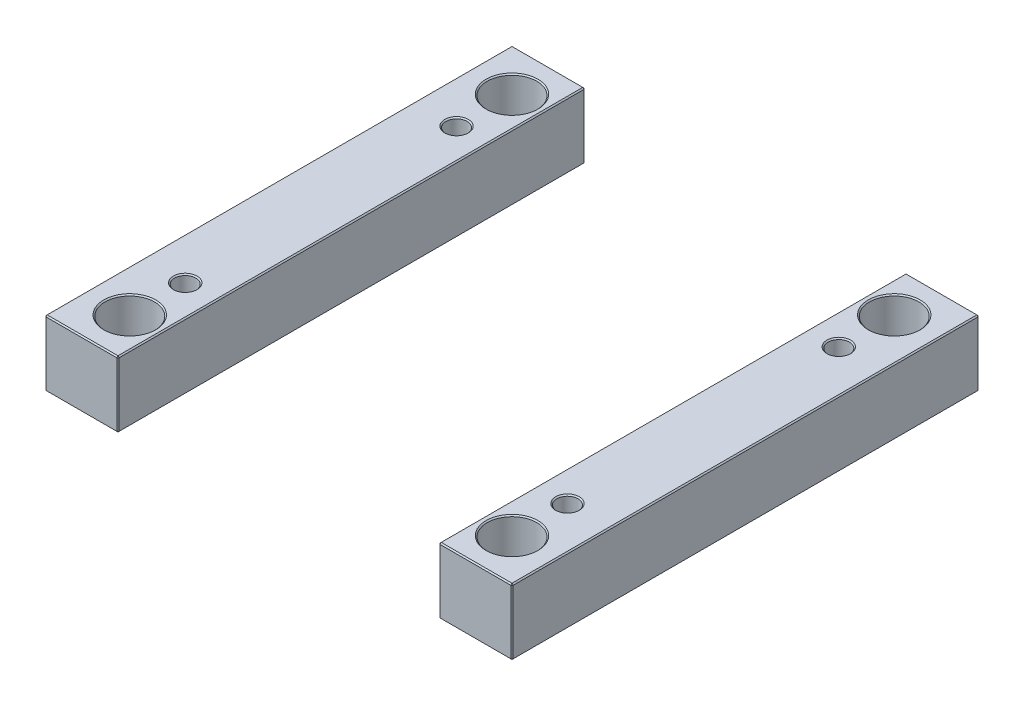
ISO-10303-21;
HEADER;
FILE_DESCRIPTION(('STEP AP214'),'2;1');
FILE_NAME('part.step','',(''),(''),'','','');
FILE_SCHEMA(('AUTOMOTIVE_DESIGN { 1 0 10303 214 1 1 1 1 }'));
ENDSEC;
DATA;
#1=APPLICATION_CONTEXT('core data for automotive mechanical design processes');
#2=APPLICATION_PROTOCOL_DEFINITION('international standard','automotive_design',2000,#1);
#3=PRODUCT_CONTEXT('',#1,'mechanical');
#4=PRODUCT('Part','Part','',(#3));
#5=PRODUCT_RELATED_PRODUCT_CATEGORY('part','',(#4));
#6=PRODUCT_DEFINITION_FORMATION('','',#4);
#7=PRODUCT_DEFINITION_CONTEXT('part definition',#1,'design');
#8=PRODUCT_DEFINITION('design','',#6,#7);
#9=PRODUCT_DEFINITION_SHAPE('','',#8);
#10=(LENGTH_UNIT() NAMED_UNIT(*) SI_UNIT(.MILLI.,.METRE.));
#11=(NAMED_UNIT(*) PLANE_ANGLE_UNIT() SI_UNIT($,.RADIAN.));
#12=(NAMED_UNIT(*) SI_UNIT($,.STERADIAN.) SOLID_ANGLE_UNIT());
#13=UNCERTAINTY_MEASURE_WITH_UNIT(LENGTH_MEASURE(1.E-05),#10,'distance_accuracy_value','');
#14=(GEOMETRIC_REPRESENTATION_CONTEXT(3) GLOBAL_UNCERTAINTY_ASSIGNED_CONTEXT((#13)) GLOBAL_UNIT_ASSIGNED_CONTEXT((#10,
#11,#12)) REPRESENTATION_CONTEXT('',''));
#15=CARTESIAN_POINT('',(0.,0.,0.));
#16=DIRECTION('',(0.,0.,1.));
#17=DIRECTION('',(1.,0.,0.));
#18=AXIS2_PLACEMENT_3D('',#15,#16,#17);
#19=CARTESIAN_POINT('',(-198.,56.,-198.));
#20=DIRECTION('',(0.,0.,1.));
#21=DIRECTION('',(1.,0.,0.));
#22=AXIS2_PLACEMENT_3D('',#19,#20,#21);
#23=PLANE('',#22);
#24=DIRECTION('',(-1.,0.,0.));
#25=VECTOR('',#24,1.);
#26=CARTESIAN_POINT('',(-198.,0.999999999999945,-198.));
#27=LINE('',#26,#25);
#28=CARTESIAN_POINT('',(-137.,0.999999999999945,-198.));
#29=VERTEX_POINT('',#28);
#30=CARTESIAN_POINT('',(-197.,0.999999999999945,-198.));
#31=VERTEX_POINT('',#30);
#32=EDGE_CURVE('P0_E137',#29,#31,#27,.T.);
#33=ORIENTED_EDGE('',*,*,#32,.T.);
#34=DIRECTION('',(0.,1.,0.));
#35=VECTOR('',#34,1.);
#36=CARTESIAN_POINT('',(-197.,56.,-198.));
#37=LINE('',#36,#35);
#38=CARTESIAN_POINT('',(-197.,55.,-198.));
#39=VERTEX_POINT('',#38);
#40=EDGE_CURVE('P0_E265',#31,#39,#37,.T.);
#41=ORIENTED_EDGE('',*,*,#40,.T.);
#42=DIRECTION('',(1.,0.,0.));
#43=VECTOR('',#42,1.);
#44=CARTESIAN_POINT('',(-198.,55.,-198.));
#45=LINE('',#44,#43);
#46=CARTESIAN_POINT('',(-137.,55.,-198.));
#47=VERTEX_POINT('',#46);
#48=EDGE_CURVE('P0_E263',#39,#47,#45,.T.);
#49=ORIENTED_EDGE('',*,*,#48,.T.);
#50=DIRECTION('',(0.,-1.,0.));
#51=VECTOR('',#50,1.);
#52=CARTESIAN_POINT('',(-137.,56.,-198.));
#53=LINE('',#52,#51);
#54=EDGE_CURVE('P0_E260',#47,#29,#53,.T.);
#55=ORIENTED_EDGE('',*,*,#54,.T.);
#56=EDGE_LOOP('',(#33,#41,#49,#55));
#57=FACE_BOUND('',#56,.T.);
#58=ADVANCED_FACE('P0_F16',(#57),#23,.F.);
#59=CARTESIAN_POINT('',(-198.,56.,198.));
#60=DIRECTION('',(1.,0.,0.));
#61=DIRECTION('',(0.,0.,-1.));
#62=AXIS2_PLACEMENT_3D('',#59,#60,#61);
#63=PLANE('',#62);
#64=DIRECTION('',(0.,1.,0.));
#65=VECTOR('',#64,1.);
#66=CARTESIAN_POINT('',(-198.,56.,197.));
#67=LINE('',#66,#65);
#68=CARTESIAN_POINT('',(-198.,0.999999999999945,197.));
#69=VERTEX_POINT('',#68);
#70=CARTESIAN_POINT('',(-198.,55.,197.));
#71=VERTEX_POINT('',#70);
#72=EDGE_CURVE('P0_E253',#69,#71,#67,.T.);
#73=ORIENTED_EDGE('',*,*,#72,.T.);
#74=DIRECTION('',(0.,0.,-1.));
#75=VECTOR('',#74,1.);
#76=CARTESIAN_POINT('',(-198.,55.,198.));
#77=LINE('',#76,#75);
#78=CARTESIAN_POINT('',(-198.,55.,-197.));
#79=VERTEX_POINT('',#78);
#80=EDGE_CURVE('P0_E258',#71,#79,#77,.T.);
#81=ORIENTED_EDGE('',*,*,#80,.T.);
#82=DIRECTION('',(0.,-1.,0.));
#83=VECTOR('',#82,1.);
#84=CARTESIAN_POINT('',(-198.,56.,-197.));
#85=LINE('',#84,#83);
#86=CARTESIAN_POINT('',(-198.,0.999999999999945,-197.));
#87=VERTEX_POINT('',#86);
#88=EDGE_CURVE('P0_E255',#79,#87,#85,.T.);
#89=ORIENTED_EDGE('',*,*,#88,.T.);
#90=DIRECTION('',(0.,0.,1.));
#91=VECTOR('',#90,1.);
#92=CARTESIAN_POINT('',(-198.,0.999999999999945,198.));
#93=LINE('',#92,#91);
#94=EDGE_CURVE('P0_E251',#87,#69,#93,.T.);
#95=ORIENTED_EDGE('',*,*,#94,.T.);
#96=EDGE_LOOP('',(#73,#81,#89,#95));
#97=FACE_BOUND('',#96,.T.);
#98=ADVANCED_FACE('P0_F333',(#97),#63,.F.);
#99=CARTESIAN_POINT('',(-198.,56.,198.));
#100=DIRECTION('',(0.,0.,-1.));
#101=DIRECTION('',(-1.,0.,0.));
#102=AXIS2_PLACEMENT_3D('',#99,#100,#101);
#103=PLANE('',#102);
#104=DIRECTION('',(-1.,0.,0.));
#105=VECTOR('',#104,1.);
#106=CARTESIAN_POINT('',(-198.,55.,198.));
#107=LINE('',#106,#105);
#108=CARTESIAN_POINT('',(-137.,55.,198.));
#109=VERTEX_POINT('',#108);
#110=CARTESIAN_POINT('',(-197.,55.,198.));
#111=VERTEX_POINT('',#110);
#112=EDGE_CURVE('P0_E272',#109,#111,#107,.T.);
#113=ORIENTED_EDGE('',*,*,#112,.T.);
#114=DIRECTION('',(0.,-1.,0.));
#115=VECTOR('',#114,1.);
#116=CARTESIAN_POINT('',(-197.,56.,198.));
#117=LINE('',#116,#115);
#118=CARTESIAN_POINT('',(-197.,0.999999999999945,198.));
#119=VERTEX_POINT('',#118);
#120=EDGE_CURVE('P0_E274',#111,#119,#117,.T.);
#121=ORIENTED_EDGE('',*,*,#120,.T.);
#122=DIRECTION('',(1.,0.,0.));
#123=VECTOR('',#122,1.);
#124=CARTESIAN_POINT('',(-136.,0.999999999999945,198.));
#125=LINE('',#124,#123);
#126=CARTESIAN_POINT('',(-137.,0.999999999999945,198.));
#127=VERTEX_POINT('',#126);
#128=EDGE_CURVE('P0_E270',#119,#127,#125,.T.);
#129=ORIENTED_EDGE('',*,*,#128,.T.);
#130=DIRECTION('',(0.,1.,0.));
#131=VECTOR('',#130,1.);
#132=CARTESIAN_POINT('',(-137.,56.,198.));
#133=LINE('',#132,#131);
#134=EDGE_CURVE('P0_E268',#127,#109,#133,.T.);
#135=ORIENTED_EDGE('',*,*,#134,.T.);
#136=EDGE_LOOP('',(#113,#121,#129,#135));
#137=FACE_BOUND('',#136,.T.);
#138=ADVANCED_FACE('P0_F372',(#137),#103,.F.);
#139=CARTESIAN_POINT('',(-136.,56.,-198.));
#140=DIRECTION('',(-1.,0.,0.));
#141=DIRECTION('',(0.,0.,1.));
#142=AXIS2_PLACEMENT_3D('',#139,#140,#141);
#143=PLANE('',#142);
#144=DIRECTION('',(0.,0.,1.));
#145=VECTOR('',#144,1.);
#146=CARTESIAN_POINT('',(-136.,55.,-198.));
#147=LINE('',#146,#145);
#148=CARTESIAN_POINT('',(-136.,55.,-197.));
#149=VERTEX_POINT('',#148);
#150=CARTESIAN_POINT('',(-136.,55.,197.));
#151=VERTEX_POINT('',#150);
#152=EDGE_CURVE('P0_E31',#149,#151,#147,.T.);
#153=ORIENTED_EDGE('',*,*,#152,.T.);
#154=DIRECTION('',(0.,-1.,0.));
#155=VECTOR('',#154,1.);
#156=CARTESIAN_POINT('',(-136.,56.,197.));
#157=LINE('',#156,#155);
#158=CARTESIAN_POINT('',(-136.,0.999999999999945,197.));
#159=VERTEX_POINT('',#158);
#160=EDGE_CURVE('P0_E190',#151,#159,#157,.T.);
#161=ORIENTED_EDGE('',*,*,#160,.T.);
#162=DIRECTION('',(0.,0.,-1.));
#163=VECTOR('',#162,1.);
#164=CARTESIAN_POINT('',(-136.,0.999999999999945,-198.));
#165=LINE('',#164,#163);
#166=CARTESIAN_POINT('',(-136.,0.999999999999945,-197.));
#167=VERTEX_POINT('',#166);
#168=EDGE_CURVE('P0_E286',#159,#167,#165,.T.);
#169=ORIENTED_EDGE('',*,*,#168,.T.);
#170=DIRECTION('',(0.,1.,0.));
#171=VECTOR('',#170,1.);
#172=CARTESIAN_POINT('',(-136.,56.,-197.));
#173=LINE('',#172,#171);
#174=EDGE_CURVE('P0_E36',#167,#149,#173,.T.);
#175=ORIENTED_EDGE('',*,*,#174,.T.);
#176=EDGE_LOOP('',(#153,#161,#169,#175));
#177=FACE_BOUND('',#176,.T.);
#178=ADVANCED_FACE('P0_F649',(#177),#143,.F.);
#179=CARTESIAN_POINT('',(0.,56.,0.));
#180=DIRECTION('',(0.,-1.,0.));
#181=DIRECTION('',(0.,0.,-1.));
#182=AXIS2_PLACEMENT_3D('',#179,#180,#181);
#183=PLANE('',#182);
#184=CARTESIAN_POINT('',(-162.,56.,-162.));
#185=DIRECTION('',(0.,-1.,0.));
#186=DIRECTION('',(0.,0.,-1.));
#187=AXIS2_PLACEMENT_3D('',#184,#185,#186);
#188=CIRCLE('',#187,22.);
#189=CARTESIAN_POINT('',(-162.,56.,-184.));
#190=VERTEX_POINT('',#189);
#191=EDGE_CURVE('P0_E214',#190,#190,#188,.T.);
#192=ORIENTED_EDGE('',*,*,#191,.T.);
#193=EDGE_LOOP('',(#192));
#194=FACE_BOUND('',#193,.T.);
#195=CARTESIAN_POINT('',(-162.,56.,162.));
#196=DIRECTION('',(0.,-1.,0.));
#197=DIRECTION('',(0.,0.,-1.));
#198=AXIS2_PLACEMENT_3D('',#195,#196,#197);
#199=CIRCLE('',#198,22.);
#200=CARTESIAN_POINT('',(-162.,56.,140.));
#201=VERTEX_POINT('',#200);
#202=EDGE_CURVE('P0_E211',#201,#201,#199,.T.);
#203=ORIENTED_EDGE('',*,*,#202,.T.);
#204=EDGE_LOOP('',(#203));
#205=FACE_BOUND('',#204,.T.);
#206=CARTESIAN_POINT('',(-162.,56.,115.));
#207=DIRECTION('',(0.,-1.,0.));
#208=DIRECTION('',(0.,0.,-1.));
#209=AXIS2_PLACEMENT_3D('',#206,#207,#208);
#210=CIRCLE('',#209,10.);
#211=CARTESIAN_POINT('',(-162.,56.,105.));
#212=VERTEX_POINT('',#211);
#213=EDGE_CURVE('P0_E193',#212,#212,#210,.T.);
#214=ORIENTED_EDGE('',*,*,#213,.T.);
#215=EDGE_LOOP('',(#214));
#216=FACE_BOUND('',#215,.T.);
#217=CARTESIAN_POINT('',(-162.,56.,-115.));
#218=DIRECTION('',(0.,-1.,0.));
#219=DIRECTION('',(0.,0.,-1.));
#220=AXIS2_PLACEMENT_3D('',#217,#218,#219);
#221=CIRCLE('',#220,10.);
#222=CARTESIAN_POINT('',(-162.,56.,-125.));
#223=VERTEX_POINT('',#222);
#224=EDGE_CURVE('P0_E189',#223,#223,#221,.T.);
#225=ORIENTED_EDGE('',*,*,#224,.T.);
#226=EDGE_LOOP('',(#225));
#227=FACE_BOUND('',#226,.T.);
#228=DIRECTION('',(0.,0.,1.));
#229=VECTOR('',#228,1.);
#230=CARTESIAN_POINT('',(-197.,56.,0.));
#231=LINE('',#230,#229);
#232=CARTESIAN_POINT('',(-197.,56.,-197.));
#233=VERTEX_POINT('',#232);
#234=CARTESIAN_POINT('',(-197.,56.,197.));
#235=VERTEX_POINT('',#234);
#236=EDGE_CURVE('P0_E281',#233,#235,#231,.T.);
#237=ORIENTED_EDGE('',*,*,#236,.T.);
#238=DIRECTION('',(1.,0.,0.));
#239=VECTOR('',#238,1.);
#240=CARTESIAN_POINT('',(-1.76382206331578E-13,56.,197.));
#241=LINE('',#240,#239);
#242=CARTESIAN_POINT('',(-137.,56.,197.));
#243=VERTEX_POINT('',#242);
#244=EDGE_CURVE('P0_E283',#235,#243,#241,.T.);
#245=ORIENTED_EDGE('',*,*,#244,.T.);
#246=DIRECTION('',(0.,0.,-1.));
#247=VECTOR('',#246,1.);
#248=CARTESIAN_POINT('',(-137.,56.,0.));
#249=LINE('',#248,#247);
#250=CARTESIAN_POINT('',(-137.,56.,-197.));
#251=VERTEX_POINT('',#250);
#252=EDGE_CURVE('P0_E277',#243,#251,#249,.T.);
#253=ORIENTED_EDGE('',*,*,#252,.T.);
#254=DIRECTION('',(-1.,0.,0.));
#255=VECTOR('',#254,1.);
#256=CARTESIAN_POINT('',(1.76382206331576E-13,56.,-197.));
#257=LINE('',#256,#255);
#258=EDGE_CURVE('P0_E279',#251,#233,#257,.T.);
#259=ORIENTED_EDGE('',*,*,#258,.T.);
#260=EDGE_LOOP('',(#237,#245,#253,#259));
#261=FACE_BOUND('',#260,.T.);
#262=ADVANCED_FACE('P0_F229',(#194,#205,#216,#227,#261),#183,.F.);
#263=CARTESIAN_POINT('',(0.,0.,0.));
#264=DIRECTION('',(0.,-1.,0.));
#265=DIRECTION('',(0.,0.,-1.));
#266=AXIS2_PLACEMENT_3D('',#263,#264,#265);
#267=PLANE('',#266);
#268=CARTESIAN_POINT('',(-162.,0.,-162.));
#269=DIRECTION('',(0.,-1.,0.));
#270=DIRECTION('',(0.,0.,-1.));
#271=AXIS2_PLACEMENT_3D('',#268,#269,#270);
#272=CIRCLE('',#271,22.);
#273=CARTESIAN_POINT('',(-162.,0.,-184.));
#274=VERTEX_POINT('',#273);
#275=EDGE_CURVE('P0_E202',#274,#274,#272,.F.);
#276=ORIENTED_EDGE('',*,*,#275,.T.);
#277=EDGE_LOOP('',(#276));
#278=FACE_BOUND('',#277,.T.);
#279=CARTESIAN_POINT('',(-162.,0.,162.));
#280=DIRECTION('',(0.,-1.,0.));
#281=DIRECTION('',(0.,0.,-1.));
#282=AXIS2_PLACEMENT_3D('',#279,#280,#281);
#283=CIRCLE('',#282,22.);
#284=CARTESIAN_POINT('',(-162.,0.,140.));
#285=VERTEX_POINT('',#284);
#286=EDGE_CURVE('P0_E199',#285,#285,#283,.F.);
#287=ORIENTED_EDGE('',*,*,#286,.T.);
#288=EDGE_LOOP('',(#287));
#289=FACE_BOUND('',#288,.T.);
#290=CARTESIAN_POINT('',(-162.,0.,-115.));
#291=DIRECTION('',(0.,-1.,0.));
#292=DIRECTION('',(0.,0.,-1.));
#293=AXIS2_PLACEMENT_3D('',#290,#291,#292);
#294=CIRCLE('',#293,10.);
#295=CARTESIAN_POINT('',(-162.,0.,-125.));
#296=VERTEX_POINT('',#295);
#297=EDGE_CURVE('P0_E235',#296,#296,#294,.F.);
#298=ORIENTED_EDGE('',*,*,#297,.T.);
#299=EDGE_LOOP('',(#298));
#300=FACE_BOUND('',#299,.T.);
#301=CARTESIAN_POINT('',(-162.,0.,115.));
#302=DIRECTION('',(0.,-1.,0.));
#303=DIRECTION('',(0.,0.,-1.));
#304=AXIS2_PLACEMENT_3D('',#301,#302,#303);
#305=CIRCLE('',#304,10.);
#306=CARTESIAN_POINT('',(-162.,0.,105.));
#307=VERTEX_POINT('',#306);
#308=EDGE_CURVE('P0_E238',#307,#307,#305,.F.);
#309=ORIENTED_EDGE('',*,*,#308,.T.);
#310=EDGE_LOOP('',(#309));
#311=FACE_BOUND('',#310,.T.);
#312=DIRECTION('',(-1.,0.,0.));
#313=VECTOR('',#312,1.);
#314=CARTESIAN_POINT('',(-198.,0.,197.));
#315=LINE('',#314,#313);
#316=CARTESIAN_POINT('',(-137.,0.,197.));
#317=VERTEX_POINT('',#316);
#318=CARTESIAN_POINT('',(-197.,0.,197.));
#319=VERTEX_POINT('',#318);
#320=EDGE_CURVE('P0_E114',#317,#319,#315,.T.);
#321=ORIENTED_EDGE('',*,*,#320,.T.);
#322=DIRECTION('',(0.,0.,-1.));
#323=VECTOR('',#322,1.);
#324=CARTESIAN_POINT('',(-197.,0.,-198.));
#325=LINE('',#324,#323);
#326=CARTESIAN_POINT('',(-197.,0.,-197.));
#327=VERTEX_POINT('',#326);
#328=EDGE_CURVE('P0_E110',#319,#327,#325,.T.);
#329=ORIENTED_EDGE('',*,*,#328,.T.);
#330=DIRECTION('',(1.,0.,0.));
#331=VECTOR('',#330,1.);
#332=CARTESIAN_POINT('',(-136.,0.,-197.));
#333=LINE('',#332,#331);
#334=CARTESIAN_POINT('',(-137.,0.,-197.));
#335=VERTEX_POINT('',#334);
#336=EDGE_CURVE('P0_E104',#327,#335,#333,.T.);
#337=ORIENTED_EDGE('',*,*,#336,.T.);
#338=DIRECTION('',(0.,0.,1.));
#339=VECTOR('',#338,1.);
#340=CARTESIAN_POINT('',(-137.,0.,198.));
#341=LINE('',#340,#339);
#342=EDGE_CURVE('P0_E107',#335,#317,#341,.T.);
#343=ORIENTED_EDGE('',*,*,#342,.T.);
#344=EDGE_LOOP('',(#321,#329,#337,#343));
#345=FACE_BOUND('',#344,.T.);
#346=ADVANCED_FACE('P0_F106',(#278,#289,#300,#311,#345),#267,.T.);
#347=CARTESIAN_POINT('',(-162.,0.,-115.));
#348=DIRECTION('',(0.,1.,0.));
#349=DIRECTION('',(0.,0.,1.));
#350=AXIS2_PLACEMENT_3D('',#347,#348,#349);
#351=CYLINDRICAL_SURFACE('',#350,9.);
#352=CARTESIAN_POINT('',(-162.,55.,-115.));
#353=DIRECTION('',(0.,-1.,0.));
#354=DIRECTION('',(0.,0.,-1.));
#355=AXIS2_PLACEMENT_3D('',#352,#353,#354);
#356=CIRCLE('',#355,9.);
#357=CARTESIAN_POINT('',(-162.,55.,-124.));
#358=VERTEX_POINT('',#357);
#359=EDGE_CURVE('P0_E196',#358,#358,#356,.F.);
#360=ORIENTED_EDGE('',*,*,#359,.T.);
#361=EDGE_LOOP('',(#360));
#362=FACE_BOUND('',#361,.T.);
#363=CARTESIAN_POINT('',(-162.,1.00000000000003,-115.));
#364=DIRECTION('',(0.,-1.,0.));
#365=DIRECTION('',(0.,0.,-1.));
#366=AXIS2_PLACEMENT_3D('',#363,#364,#365);
#367=CIRCLE('',#366,9.);
#368=CARTESIAN_POINT('',(-162.,1.00000000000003,-124.));
#369=VERTEX_POINT('',#368);
#370=EDGE_CURVE('P0_E241',#369,#369,#367,.T.);
#371=ORIENTED_EDGE('',*,*,#370,.T.);
#372=EDGE_LOOP('',(#371));
#373=FACE_BOUND('',#372,.T.);
#374=ADVANCED_FACE('P0_F228',(#362,#373),#351,.F.);
#375=CARTESIAN_POINT('',(-162.,0.,115.));
#376=DIRECTION('',(0.,1.,0.));
#377=DIRECTION('',(0.,0.,1.));
#378=AXIS2_PLACEMENT_3D('',#375,#376,#377);
#379=CYLINDRICAL_SURFACE('',#378,9.);
#380=CARTESIAN_POINT('',(-162.,55.,115.));
#381=DIRECTION('',(0.,-1.,0.));
#382=DIRECTION('',(0.,0.,-1.));
#383=AXIS2_PLACEMENT_3D('',#380,#381,#382);
#384=CIRCLE('',#383,9.);
#385=CARTESIAN_POINT('',(-162.,55.,106.));
#386=VERTEX_POINT('',#385);
#387=EDGE_CURVE('P0_E186',#386,#386,#384,.F.);
#388=ORIENTED_EDGE('',*,*,#387,.T.);
#389=EDGE_LOOP('',(#388));
#390=FACE_BOUND('',#389,.T.);
#391=CARTESIAN_POINT('',(-162.,1.00000000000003,115.));
#392=DIRECTION('',(0.,-1.,0.));
#393=DIRECTION('',(0.,0.,-1.));
#394=AXIS2_PLACEMENT_3D('',#391,#392,#393);
#395=CIRCLE('',#394,9.);
#396=CARTESIAN_POINT('',(-162.,1.00000000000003,106.));
#397=VERTEX_POINT('',#396);
#398=EDGE_CURVE('P0_E248',#397,#397,#395,.T.);
#399=ORIENTED_EDGE('',*,*,#398,.T.);
#400=EDGE_LOOP('',(#399));
#401=FACE_BOUND('',#400,.T.);
#402=ADVANCED_FACE('P0_F380',(#390,#401),#379,.F.);
#403=CARTESIAN_POINT('',(-162.,0.,-115.));
#404=DIRECTION('',(0.,-1.,0.));
#405=DIRECTION('',(0.,0.,-1.));
#406=AXIS2_PLACEMENT_3D('',#403,#404,#405);
#407=CONICAL_SURFACE('',#406,10.,0.785398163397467);
#408=ORIENTED_EDGE('',*,*,#370,.F.);
#409=EDGE_LOOP('',(#408));
#410=FACE_BOUND('',#409,.T.);
#411=ORIENTED_EDGE('',*,*,#297,.F.);
#412=EDGE_LOOP('',(#411));
#413=FACE_BOUND('',#412,.T.);
#414=ADVANCED_FACE('P0_F376',(#410,#413),#407,.F.);
#415=CARTESIAN_POINT('',(-162.,0.,115.));
#416=DIRECTION('',(0.,-1.,0.));
#417=DIRECTION('',(0.,0.,-1.));
#418=AXIS2_PLACEMENT_3D('',#415,#416,#417);
#419=CONICAL_SURFACE('',#418,10.,0.78539816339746);
#420=ORIENTED_EDGE('',*,*,#398,.F.);
#421=EDGE_LOOP('',(#420));
#422=FACE_BOUND('',#421,.T.);
#423=ORIENTED_EDGE('',*,*,#308,.F.);
#424=EDGE_LOOP('',(#423));
#425=FACE_BOUND('',#424,.T.);
#426=ADVANCED_FACE('P0_F379',(#422,#425),#419,.F.);
#427=CARTESIAN_POINT('',(-136.,56.,197.));
#428=DIRECTION('',(-0.707106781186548,0.,-0.707106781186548));
#429=DIRECTION('',(0.,-1.,0.));
#430=AXIS2_PLACEMENT_3D('',#427,#428,#429);
#431=PLANE('',#430);
#432=DIRECTION('',(-0.707106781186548,0.,0.707106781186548));
#433=VECTOR('',#432,1.);
#434=CARTESIAN_POINT('',(-136.5,55.,197.5));
#435=LINE('',#434,#433);
#436=EDGE_CURVE('P0_E125',#109,#151,#435,.F.);
#437=ORIENTED_EDGE('',*,*,#436,.F.);
#438=ORIENTED_EDGE('',*,*,#134,.F.);
#439=DIRECTION('',(0.707106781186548,0.,-0.707106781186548));
#440=VECTOR('',#439,1.);
#441=CARTESIAN_POINT('',(-137.,0.999999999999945,198.));
#442=LINE('',#441,#440);
#443=EDGE_CURVE('P0_E181',#159,#127,#442,.F.);
#444=ORIENTED_EDGE('',*,*,#443,.F.);
#445=ORIENTED_EDGE('',*,*,#160,.F.);
#446=EDGE_LOOP('',(#437,#438,#444,#445));
#447=FACE_BOUND('',#446,.T.);
#448=ADVANCED_FACE('P0_F384',(#447),#431,.F.);
#449=CARTESIAN_POINT('',(-137.,56.,197.));
#450=DIRECTION('',(0.577350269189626,0.577350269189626,0.577350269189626));
#451=DIRECTION('',(0.707106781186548,0.,-0.707106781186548));
#452=AXIS2_PLACEMENT_3D('',#449,#450,#451);
#453=PLANE('',#452);
#454=DIRECTION('',(0.,0.707106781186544,-0.707106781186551));
#455=VECTOR('',#454,1.);
#456=CARTESIAN_POINT('',(-137.,56.,197.));
#457=LINE('',#456,#455);
#458=EDGE_CURVE('P0_E175',#109,#243,#457,.T.);
#459=ORIENTED_EDGE('',*,*,#458,.F.);
#460=ORIENTED_EDGE('',*,*,#436,.T.);
#461=DIRECTION('',(0.707106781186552,-0.707106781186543,0.));
#462=VECTOR('',#461,1.);
#463=CARTESIAN_POINT('',(-137.,56.,197.));
#464=LINE('',#463,#462);
#465=EDGE_CURVE('P0_E178',#243,#151,#464,.T.);
#466=ORIENTED_EDGE('',*,*,#465,.F.);
#467=EDGE_LOOP('',(#459,#460,#466));
#468=FACE_BOUND('',#467,.T.);
#469=ADVANCED_FACE('P0_F588',(#468),#453,.T.);
#470=CARTESIAN_POINT('',(-137.,0.999999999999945,198.));
#471=DIRECTION('',(0.577350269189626,-0.577350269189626,0.577350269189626));
#472=DIRECTION('',(0.707106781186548,0.,-0.707106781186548));
#473=AXIS2_PLACEMENT_3D('',#470,#471,#472);
#474=PLANE('',#473);
#475=DIRECTION('',(0.707106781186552,0.707106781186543,0.));
#476=VECTOR('',#475,1.);
#477=CARTESIAN_POINT('',(-136.5,0.499999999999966,197.));
#478=LINE('',#477,#476);
#479=EDGE_CURVE('P0_E123',#159,#317,#478,.F.);
#480=ORIENTED_EDGE('',*,*,#479,.F.);
#481=ORIENTED_EDGE('',*,*,#443,.T.);
#482=DIRECTION('',(0.,-0.707106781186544,-0.707106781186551));
#483=VECTOR('',#482,1.);
#484=CARTESIAN_POINT('',(-137.,0.999999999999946,198.));
#485=LINE('',#484,#483);
#486=EDGE_CURVE('P0_E172',#317,#127,#485,.F.);
#487=ORIENTED_EDGE('',*,*,#486,.F.);
#488=EDGE_LOOP('',(#480,#481,#487));
#489=FACE_BOUND('',#488,.T.);
#490=ADVANCED_FACE('P0_F597',(#489),#474,.T.);
#491=CARTESIAN_POINT('',(-137.,56.,0.));
#492=DIRECTION('',(-0.707106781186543,-0.707106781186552,0.));
#493=DIRECTION('',(0.,0.,-1.));
#494=AXIS2_PLACEMENT_3D('',#491,#492,#493);
#495=PLANE('',#494);
#496=ORIENTED_EDGE('',*,*,#465,.T.);
#497=ORIENTED_EDGE('',*,*,#152,.F.);
#498=DIRECTION('',(-0.707106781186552,0.707106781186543,0.));
#499=VECTOR('',#498,1.);
#500=CARTESIAN_POINT('',(-136.5,55.5,-197.));
#501=LINE('',#500,#499);
#502=EDGE_CURVE('P0_E165',#251,#149,#501,.F.);
#503=ORIENTED_EDGE('',*,*,#502,.F.);
#504=ORIENTED_EDGE('',*,*,#252,.F.);
#505=EDGE_LOOP('',(#496,#497,#503,#504));
#506=FACE_BOUND('',#505,.T.);
#507=ADVANCED_FACE('P0_F349',(#506),#495,.F.);
#508=CARTESIAN_POINT('',(-1.76382206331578E-13,56.,197.));
#509=DIRECTION('',(0.,-0.707106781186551,-0.707106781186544));
#510=DIRECTION('',(1.,0.,0.));
#511=AXIS2_PLACEMENT_3D('',#508,#509,#510);
#512=PLANE('',#511);
#513=ORIENTED_EDGE('',*,*,#458,.T.);
#514=ORIENTED_EDGE('',*,*,#244,.F.);
#515=DIRECTION('',(0.,-0.707106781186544,0.707106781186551));
#516=VECTOR('',#515,1.);
#517=CARTESIAN_POINT('',(-197.,55.5,197.5));
#518=LINE('',#517,#516);
#519=EDGE_CURVE('P0_E162',#111,#235,#518,.F.);
#520=ORIENTED_EDGE('',*,*,#519,.F.);
#521=ORIENTED_EDGE('',*,*,#112,.F.);
#522=EDGE_LOOP('',(#513,#514,#520,#521));
#523=FACE_BOUND('',#522,.T.);
#524=ADVANCED_FACE('P0_F344',(#523),#512,.F.);
#525=CARTESIAN_POINT('',(-197.,56.,198.));
#526=DIRECTION('',(0.707106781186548,0.,-0.707106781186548));
#527=DIRECTION('',(0.,-1.,0.));
#528=AXIS2_PLACEMENT_3D('',#525,#526,#527);
#529=PLANE('',#528);
#530=DIRECTION('',(0.707106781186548,0.,0.707106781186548));
#531=VECTOR('',#530,1.);
#532=CARTESIAN_POINT('',(-197.,0.999999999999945,198.));
#533=LINE('',#532,#531);
#534=EDGE_CURVE('P0_E156',#119,#69,#533,.F.);
#535=ORIENTED_EDGE('',*,*,#534,.F.);
#536=ORIENTED_EDGE('',*,*,#120,.F.);
#537=DIRECTION('',(-0.707106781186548,0.,-0.707106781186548));
#538=VECTOR('',#537,1.);
#539=CARTESIAN_POINT('',(-198.,55.,197.));
#540=LINE('',#539,#538);
#541=EDGE_CURVE('P0_E159',#71,#111,#540,.F.);
#542=ORIENTED_EDGE('',*,*,#541,.F.);
#543=ORIENTED_EDGE('',*,*,#72,.F.);
#544=EDGE_LOOP('',(#535,#536,#542,#543));
#545=FACE_BOUND('',#544,.T.);
#546=ADVANCED_FACE('P0_F338',(#545),#529,.F.);
#547=CARTESIAN_POINT('',(-198.,0.999999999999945,198.));
#548=DIRECTION('',(0.,-0.707106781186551,0.707106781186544));
#549=DIRECTION('',(-1.,0.,0.));
#550=AXIS2_PLACEMENT_3D('',#547,#548,#549);
#551=PLANE('',#550);
#552=ORIENTED_EDGE('',*,*,#486,.T.);
#553=ORIENTED_EDGE('',*,*,#128,.F.);
#554=DIRECTION('',(0.,0.707106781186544,0.707106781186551));
#555=VECTOR('',#554,1.);
#556=CARTESIAN_POINT('',(-197.,0.999999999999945,198.));
#557=LINE('',#556,#555);
#558=EDGE_CURVE('P0_E134',#319,#119,#557,.T.);
#559=ORIENTED_EDGE('',*,*,#558,.F.);
#560=ORIENTED_EDGE('',*,*,#320,.F.);
#561=EDGE_LOOP('',(#552,#553,#559,#560));
#562=FACE_BOUND('',#561,.T.);
#563=ADVANCED_FACE('P0_F364',(#562),#551,.T.);
#564=CARTESIAN_POINT('',(-136.,0.999999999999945,-198.));
#565=DIRECTION('',(0.707106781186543,-0.707106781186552,0.));
#566=DIRECTION('',(0.,0.,1.));
#567=AXIS2_PLACEMENT_3D('',#564,#565,#566);
#568=PLANE('',#567);
#569=ORIENTED_EDGE('',*,*,#479,.T.);
#570=ORIENTED_EDGE('',*,*,#342,.F.);
#571=DIRECTION('',(-0.707106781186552,-0.707106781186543,0.));
#572=VECTOR('',#571,1.);
#573=CARTESIAN_POINT('',(-137.,0.,-197.));
#574=LINE('',#573,#572);
#575=EDGE_CURVE('P0_E120',#167,#335,#574,.T.);
#576=ORIENTED_EDGE('',*,*,#575,.F.);
#577=ORIENTED_EDGE('',*,*,#168,.F.);
#578=EDGE_LOOP('',(#569,#570,#576,#577));
#579=FACE_BOUND('',#578,.T.);
#580=ADVANCED_FACE('P0_F119',(#579),#568,.T.);
#581=CARTESIAN_POINT('',(-137.,56.,-198.));
#582=DIRECTION('',(-0.707106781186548,0.,0.707106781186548));
#583=DIRECTION('',(0.,-1.,0.));
#584=AXIS2_PLACEMENT_3D('',#581,#582,#583);
#585=PLANE('',#584);
#586=DIRECTION('',(0.707106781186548,0.,0.707106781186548));
#587=VECTOR('',#586,1.);
#588=CARTESIAN_POINT('',(-137.,55.,-198.));
#589=LINE('',#588,#587);
#590=EDGE_CURVE('P0_E168',#149,#47,#589,.F.);
#591=ORIENTED_EDGE('',*,*,#590,.F.);
#592=ORIENTED_EDGE('',*,*,#174,.F.);
#593=DIRECTION('',(-0.707106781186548,0.,-0.707106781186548));
#594=VECTOR('',#593,1.);
#595=CARTESIAN_POINT('',(-136.5,0.999999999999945,-197.5));
#596=LINE('',#595,#594);
#597=EDGE_CURVE('P0_E133',#29,#167,#596,.F.);
#598=ORIENTED_EDGE('',*,*,#597,.F.);
#599=ORIENTED_EDGE('',*,*,#54,.F.);
#600=EDGE_LOOP('',(#591,#592,#598,#599));
#601=FACE_BOUND('',#600,.T.);
#602=ADVANCED_FACE('P0_F354',(#601),#585,.F.);
#603=CARTESIAN_POINT('',(-137.,55.,-198.));
#604=DIRECTION('',(0.577350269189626,0.577350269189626,-0.577350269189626));
#605=DIRECTION('',(-0.707106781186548,0.,-0.707106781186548));
#606=AXIS2_PLACEMENT_3D('',#603,#604,#605);
#607=PLANE('',#606);
#608=ORIENTED_EDGE('',*,*,#502,.T.);
#609=ORIENTED_EDGE('',*,*,#590,.T.);
#610=DIRECTION('',(0.,-0.707106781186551,-0.707106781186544));
#611=VECTOR('',#610,1.);
#612=CARTESIAN_POINT('',(-137.,55.,-198.));
#613=LINE('',#612,#611);
#614=EDGE_CURVE('P0_E151',#251,#47,#613,.T.);
#615=ORIENTED_EDGE('',*,*,#614,.F.);
#616=EDGE_LOOP('',(#608,#609,#615));
#617=FACE_BOUND('',#616,.T.);
#618=ADVANCED_FACE('P0_F352',(#617),#607,.T.);
#619=CARTESIAN_POINT('',(-198.,55.,197.));
#620=DIRECTION('',(-0.577350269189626,0.577350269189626,0.577350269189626));
#621=DIRECTION('',(0.707106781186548,0.,0.707106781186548));
#622=AXIS2_PLACEMENT_3D('',#619,#620,#621);
#623=PLANE('',#622);
#624=ORIENTED_EDGE('',*,*,#541,.T.);
#625=ORIENTED_EDGE('',*,*,#519,.T.);
#626=DIRECTION('',(0.707106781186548,0.707106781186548,0.));
#627=VECTOR('',#626,1.);
#628=CARTESIAN_POINT('',(-198.,55.,197.));
#629=LINE('',#628,#627);
#630=EDGE_CURVE('P0_E142',#71,#235,#629,.T.);
#631=ORIENTED_EDGE('',*,*,#630,.F.);
#632=EDGE_LOOP('',(#624,#625,#631));
#633=FACE_BOUND('',#632,.T.);
#634=ADVANCED_FACE('P0_F341',(#633),#623,.T.);
#635=CARTESIAN_POINT('',(-197.,0.999999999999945,198.));
#636=DIRECTION('',(-0.577350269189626,-0.577350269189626,0.577350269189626));
#637=DIRECTION('',(0.707106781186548,0.,0.707106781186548));
#638=AXIS2_PLACEMENT_3D('',#635,#636,#637);
#639=PLANE('',#638);
#640=ORIENTED_EDGE('',*,*,#558,.T.);
#641=ORIENTED_EDGE('',*,*,#534,.T.);
#642=DIRECTION('',(0.707106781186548,-0.707106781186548,0.));
#643=VECTOR('',#642,1.);
#644=CARTESIAN_POINT('',(-197.5,0.499999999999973,197.));
#645=LINE('',#644,#643);
#646=EDGE_CURVE('P0_E138',#319,#69,#645,.F.);
#647=ORIENTED_EDGE('',*,*,#646,.F.);
#648=EDGE_LOOP('',(#640,#641,#647));
#649=FACE_BOUND('',#648,.T.);
#650=ADVANCED_FACE('P0_F403',(#649),#639,.T.);
#651=CARTESIAN_POINT('',(-137.,0.,-197.));
#652=DIRECTION('',(0.577350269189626,-0.577350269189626,-0.577350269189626));
#653=DIRECTION('',(-0.707106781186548,0.,-0.707106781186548));
#654=AXIS2_PLACEMENT_3D('',#651,#652,#653);
#655=PLANE('',#654);
#656=ORIENTED_EDGE('',*,*,#597,.T.);
#657=ORIENTED_EDGE('',*,*,#575,.T.);
#658=DIRECTION('',(0.,0.707106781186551,-0.707106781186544));
#659=VECTOR('',#658,1.);
#660=CARTESIAN_POINT('',(-137.,0.,-197.));
#661=LINE('',#660,#659);
#662=EDGE_CURVE('P0_E130',#29,#335,#661,.F.);
#663=ORIENTED_EDGE('',*,*,#662,.F.);
#664=EDGE_LOOP('',(#656,#657,#663));
#665=FACE_BOUND('',#664,.T.);
#666=ADVANCED_FACE('P0_F129',(#665),#655,.T.);
#667=CARTESIAN_POINT('',(1.76382206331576E-13,56.,-197.));
#668=DIRECTION('',(0.,-0.707106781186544,0.707106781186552));
#669=DIRECTION('',(-1.,0.,0.));
#670=AXIS2_PLACEMENT_3D('',#667,#668,#669);
#671=PLANE('',#670);
#672=ORIENTED_EDGE('',*,*,#614,.T.);
#673=ORIENTED_EDGE('',*,*,#48,.F.);
#674=DIRECTION('',(0.,0.707106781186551,0.707106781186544));
#675=VECTOR('',#674,1.);
#676=CARTESIAN_POINT('',(-197.,55.,-198.));
#677=LINE('',#676,#675);
#678=EDGE_CURVE('P0_E139',#233,#39,#677,.F.);
#679=ORIENTED_EDGE('',*,*,#678,.F.);
#680=ORIENTED_EDGE('',*,*,#258,.F.);
#681=EDGE_LOOP('',(#672,#673,#679,#680));
#682=FACE_BOUND('',#681,.T.);
#683=ADVANCED_FACE('P0_F316',(#682),#671,.F.);
#684=CARTESIAN_POINT('',(-197.,56.,0.));
#685=DIRECTION('',(0.707106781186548,-0.707106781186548,0.));
#686=DIRECTION('',(0.,0.,1.));
#687=AXIS2_PLACEMENT_3D('',#684,#685,#686);
#688=PLANE('',#687);
#689=ORIENTED_EDGE('',*,*,#630,.T.);
#690=ORIENTED_EDGE('',*,*,#236,.F.);
#691=DIRECTION('',(-0.707106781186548,-0.707106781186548,0.));
#692=VECTOR('',#691,1.);
#693=CARTESIAN_POINT('',(-197.5,55.5,-197.));
#694=LINE('',#693,#692);
#695=EDGE_CURVE('P0_E145',#79,#233,#694,.F.);
#696=ORIENTED_EDGE('',*,*,#695,.F.);
#697=ORIENTED_EDGE('',*,*,#80,.F.);
#698=EDGE_LOOP('',(#689,#690,#696,#697));
#699=FACE_BOUND('',#698,.T.);
#700=ADVANCED_FACE('P0_F310',(#699),#688,.F.);
#701=CARTESIAN_POINT('',(-198.,0.999999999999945,198.));
#702=DIRECTION('',(-0.707106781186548,-0.707106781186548,0.));
#703=DIRECTION('',(0.,0.,-1.));
#704=AXIS2_PLACEMENT_3D('',#701,#702,#703);
#705=PLANE('',#704);
#706=ORIENTED_EDGE('',*,*,#646,.T.);
#707=ORIENTED_EDGE('',*,*,#94,.F.);
#708=DIRECTION('',(-0.707106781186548,0.707106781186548,0.));
#709=VECTOR('',#708,1.);
#710=CARTESIAN_POINT('',(-198.,0.999999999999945,-197.));
#711=LINE('',#710,#709);
#712=EDGE_CURVE('P0_E297',#327,#87,#711,.T.);
#713=ORIENTED_EDGE('',*,*,#712,.F.);
#714=ORIENTED_EDGE('',*,*,#328,.F.);
#715=EDGE_LOOP('',(#706,#707,#713,#714));
#716=FACE_BOUND('',#715,.T.);
#717=ADVANCED_FACE('P0_F329',(#716),#705,.T.);
#718=CARTESIAN_POINT('',(-198.,0.999999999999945,-198.));
#719=DIRECTION('',(0.,-0.707106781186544,-0.707106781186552));
#720=DIRECTION('',(1.,0.,0.));
#721=AXIS2_PLACEMENT_3D('',#718,#719,#720);
#722=PLANE('',#721);
#723=ORIENTED_EDGE('',*,*,#662,.T.);
#724=ORIENTED_EDGE('',*,*,#336,.F.);
#725=DIRECTION('',(0.,-0.707106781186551,0.707106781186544));
#726=VECTOR('',#725,1.);
#727=CARTESIAN_POINT('',(-197.,0.499999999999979,-197.5));
#728=LINE('',#727,#726);
#729=EDGE_CURVE('P0_E295',#31,#327,#728,.T.);
#730=ORIENTED_EDGE('',*,*,#729,.F.);
#731=ORIENTED_EDGE('',*,*,#32,.F.);
#732=EDGE_LOOP('',(#723,#724,#730,#731));
#733=FACE_BOUND('',#732,.T.);
#734=ADVANCED_FACE('P0_F136',(#733),#722,.T.);
#735=CARTESIAN_POINT('',(-197.,55.,-198.));
#736=DIRECTION('',(-0.577350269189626,0.577350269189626,-0.577350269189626));
#737=DIRECTION('',(-0.707106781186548,0.,0.707106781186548));
#738=AXIS2_PLACEMENT_3D('',#735,#736,#737);
#739=PLANE('',#738);
#740=ORIENTED_EDGE('',*,*,#695,.T.);
#741=ORIENTED_EDGE('',*,*,#678,.T.);
#742=DIRECTION('',(0.707106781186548,0.,-0.707106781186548));
#743=VECTOR('',#742,1.);
#744=CARTESIAN_POINT('',(-197.,55.,-198.));
#745=LINE('',#744,#743);
#746=EDGE_CURVE('P0_E293',#79,#39,#745,.T.);
#747=ORIENTED_EDGE('',*,*,#746,.F.);
#748=EDGE_LOOP('',(#740,#741,#747));
#749=FACE_BOUND('',#748,.T.);
#750=ADVANCED_FACE('P0_F303',(#749),#739,.T.);
#751=CARTESIAN_POINT('',(-198.,0.999999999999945,-197.));
#752=DIRECTION('',(-0.577350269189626,-0.577350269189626,-0.577350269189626));
#753=DIRECTION('',(-0.707106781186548,0.,0.707106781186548));
#754=AXIS2_PLACEMENT_3D('',#751,#752,#753);
#755=PLANE('',#754);
#756=ORIENTED_EDGE('',*,*,#729,.T.);
#757=ORIENTED_EDGE('',*,*,#712,.T.);
#758=DIRECTION('',(-0.707106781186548,0.,0.707106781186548));
#759=VECTOR('',#758,1.);
#760=CARTESIAN_POINT('',(-198.,0.999999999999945,-197.));
#761=LINE('',#760,#759);
#762=EDGE_CURVE('P0_E291',#31,#87,#761,.T.);
#763=ORIENTED_EDGE('',*,*,#762,.F.);
#764=EDGE_LOOP('',(#756,#757,#763));
#765=FACE_BOUND('',#764,.T.);
#766=ADVANCED_FACE('P0_F325',(#765),#755,.T.);
#767=CARTESIAN_POINT('',(-198.,56.,-197.));
#768=DIRECTION('',(0.707106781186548,0.,0.707106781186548));
#769=DIRECTION('',(0.,-1.,0.));
#770=AXIS2_PLACEMENT_3D('',#767,#768,#769);
#771=PLANE('',#770);
#772=ORIENTED_EDGE('',*,*,#746,.T.);
#773=ORIENTED_EDGE('',*,*,#40,.F.);
#774=ORIENTED_EDGE('',*,*,#762,.T.);
#775=ORIENTED_EDGE('',*,*,#88,.F.);
#776=EDGE_LOOP('',(#772,#773,#774,#775));
#777=FACE_BOUND('',#776,.T.);
#778=ADVANCED_FACE('P0_F323',(#777),#771,.F.);
#779=CARTESIAN_POINT('',(-162.,55.,115.));
#780=DIRECTION('',(0.,1.,0.));
#781=DIRECTION('',(0.,0.,1.));
#782=AXIS2_PLACEMENT_3D('',#779,#780,#781);
#783=CONICAL_SURFACE('',#782,9.,0.785398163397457);
#784=ORIENTED_EDGE('',*,*,#213,.F.);
#785=EDGE_LOOP('',(#784));
#786=FACE_BOUND('',#785,.T.);
#787=ORIENTED_EDGE('',*,*,#387,.F.);
#788=EDGE_LOOP('',(#787));
#789=FACE_BOUND('',#788,.T.);
#790=ADVANCED_FACE('P0_F388',(#786,#789),#783,.F.);
#791=CARTESIAN_POINT('',(-162.,55.,-115.));
#792=DIRECTION('',(0.,1.,0.));
#793=DIRECTION('',(0.,0.,1.));
#794=AXIS2_PLACEMENT_3D('',#791,#792,#793);
#795=CONICAL_SURFACE('',#794,9.,0.785398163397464);
#796=ORIENTED_EDGE('',*,*,#224,.F.);
#797=EDGE_LOOP('',(#796));
#798=FACE_BOUND('',#797,.T.);
#799=ORIENTED_EDGE('',*,*,#359,.F.);
#800=EDGE_LOOP('',(#799));
#801=FACE_BOUND('',#800,.T.);
#802=ADVANCED_FACE('P0_F470',(#798,#801),#795,.F.);
#803=CARTESIAN_POINT('',(-162.,0.,162.));
#804=DIRECTION('',(0.,1.,0.));
#805=DIRECTION('',(0.,0.,1.));
#806=AXIS2_PLACEMENT_3D('',#803,#804,#805);
#807=CYLINDRICAL_SURFACE('',#806,21.);
#808=CARTESIAN_POINT('',(-162.,55.,162.));
#809=DIRECTION('',(0.,-1.,0.));
#810=DIRECTION('',(0.,0.,-1.));
#811=AXIS2_PLACEMENT_3D('',#808,#809,#810);
#812=CIRCLE('',#811,21.);
#813=CARTESIAN_POINT('',(-162.,55.,141.));
#814=VERTEX_POINT('',#813);
#815=EDGE_CURVE('P0_E10',#814,#814,#812,.F.);
#816=ORIENTED_EDGE('',*,*,#815,.T.);
#817=EDGE_LOOP('',(#816));
#818=FACE_BOUND('',#817,.T.);
#819=CARTESIAN_POINT('',(-162.,1.,162.));
#820=DIRECTION('',(0.,-1.,0.));
#821=DIRECTION('',(0.,0.,-1.));
#822=AXIS2_PLACEMENT_3D('',#819,#820,#821);
#823=CIRCLE('',#822,21.);
#824=CARTESIAN_POINT('',(-162.,1.,141.));
#825=VERTEX_POINT('',#824);
#826=EDGE_CURVE('P0_E24',#825,#825,#823,.T.);
#827=ORIENTED_EDGE('',*,*,#826,.T.);
#828=EDGE_LOOP('',(#827));
#829=FACE_BOUND('',#828,.T.);
#830=ADVANCED_FACE('P0_F219',(#818,#829),#807,.F.);
#831=CARTESIAN_POINT('',(-162.,0.,-162.));
#832=DIRECTION('',(0.,1.,0.));
#833=DIRECTION('',(0.,0.,1.));
#834=AXIS2_PLACEMENT_3D('',#831,#832,#833);
#835=CYLINDRICAL_SURFACE('',#834,21.);
#836=CARTESIAN_POINT('',(-162.,1.00000000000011,-162.));
#837=DIRECTION('',(0.,-1.,0.));
#838=DIRECTION('',(0.,0.,-1.));
#839=AXIS2_PLACEMENT_3D('',#836,#837,#838);
#840=CIRCLE('',#839,21.);
#841=CARTESIAN_POINT('',(-162.,1.00000000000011,-183.));
#842=VERTEX_POINT('',#841);
#843=EDGE_CURVE('P0_E208',#842,#842,#840,.T.);
#844=ORIENTED_EDGE('',*,*,#843,.T.);
#845=EDGE_LOOP('',(#844));
#846=FACE_BOUND('',#845,.T.);
#847=CARTESIAN_POINT('',(-162.,55.,-162.));
#848=DIRECTION('',(0.,-1.,0.));
#849=DIRECTION('',(0.,0.,-1.));
#850=AXIS2_PLACEMENT_3D('',#847,#848,#849);
#851=CIRCLE('',#850,21.);
#852=CARTESIAN_POINT('',(-162.,55.,-183.));
#853=VERTEX_POINT('',#852);
#854=EDGE_CURVE('P0_E205',#853,#853,#851,.F.);
#855=ORIENTED_EDGE('',*,*,#854,.T.);
#856=EDGE_LOOP('',(#855));
#857=FACE_BOUND('',#856,.T.);
#858=ADVANCED_FACE('P0_F487',(#846,#857),#835,.F.);
#859=CARTESIAN_POINT('',(-162.,0.,-162.));
#860=DIRECTION('',(0.,-1.,0.));
#861=DIRECTION('',(0.,0.,-1.));
#862=AXIS2_PLACEMENT_3D('',#859,#860,#861);
#863=CONICAL_SURFACE('',#862,22.,0.785398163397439);
#864=ORIENTED_EDGE('',*,*,#843,.F.);
#865=EDGE_LOOP('',(#864));
#866=FACE_BOUND('',#865,.T.);
#867=ORIENTED_EDGE('',*,*,#275,.F.);
#868=EDGE_LOOP('',(#867));
#869=FACE_BOUND('',#868,.T.);
#870=ADVANCED_FACE('P0_F496',(#866,#869),#863,.F.);
#871=CARTESIAN_POINT('',(-162.,55.,-162.));
#872=DIRECTION('',(0.,1.,0.));
#873=DIRECTION('',(0.,0.,1.));
#874=AXIS2_PLACEMENT_3D('',#871,#872,#873);
#875=CONICAL_SURFACE('',#874,21.,0.785398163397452);
#876=ORIENTED_EDGE('',*,*,#191,.F.);
#877=EDGE_LOOP('',(#876));
#878=FACE_BOUND('',#877,.T.);
#879=ORIENTED_EDGE('',*,*,#854,.F.);
#880=EDGE_LOOP('',(#879));
#881=FACE_BOUND('',#880,.T.);
#882=ADVANCED_FACE('P0_F505',(#878,#881),#875,.F.);
#883=CARTESIAN_POINT('',(-162.,55.,162.));
#884=DIRECTION('',(0.,1.,0.));
#885=DIRECTION('',(0.,0.,1.));
#886=AXIS2_PLACEMENT_3D('',#883,#884,#885);
#887=CONICAL_SURFACE('',#886,21.,0.785398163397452);
#888=ORIENTED_EDGE('',*,*,#202,.F.);
#889=EDGE_LOOP('',(#888));
#890=FACE_BOUND('',#889,.T.);
#891=ORIENTED_EDGE('',*,*,#815,.F.);
#892=EDGE_LOOP('',(#891));
#893=FACE_BOUND('',#892,.T.);
#894=ADVANCED_FACE('P0_F223',(#890,#893),#887,.F.);
#895=CARTESIAN_POINT('',(-162.,0.,162.));
#896=DIRECTION('',(0.,-1.,0.));
#897=DIRECTION('',(0.,0.,-1.));
#898=AXIS2_PLACEMENT_3D('',#895,#896,#897);
#899=CONICAL_SURFACE('',#898,22.,0.785398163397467);
#900=ORIENTED_EDGE('',*,*,#826,.F.);
#901=EDGE_LOOP('',(#900));
#902=FACE_BOUND('',#901,.T.);
#903=ORIENTED_EDGE('',*,*,#286,.F.);
#904=EDGE_LOOP('',(#903));
#905=FACE_BOUND('',#904,.T.);
#906=ADVANCED_FACE('P0_F18',(#902,#905),#899,.F.);
#907=CLOSED_SHELL('',(#58,#98,#138,#178,#262,#346,#374,#402,#414,#426,#448,#469,#490,#507,#524,
#546,#563,#580,#602,#618,#634,#650,#666,#683,#700,#717,#734,#750,#766,#778,#790,#802,#830,#858,
#870,#882,#894,#906));
#908=MANIFOLD_SOLID_BREP('P0_B1',#907);
#909=CARTESIAN_POINT('',(198.,56.,198.));
#910=DIRECTION('',(0.,0.,-1.));
#911=DIRECTION('',(-1.,0.,0.));
#912=AXIS2_PLACEMENT_3D('',#909,#910,#911);
#913=PLANE('',#912);
#914=DIRECTION('',(0.,-1.,0.));
#915=VECTOR('',#914,1.);
#916=CARTESIAN_POINT('',(137.,56.,198.));
#917=LINE('',#916,#915);
#918=CARTESIAN_POINT('',(137.,55.,198.));
#919=VERTEX_POINT('',#918);
#920=CARTESIAN_POINT('',(137.,1.,198.));
#921=VERTEX_POINT('',#920);
#922=EDGE_CURVE('P1_E175',#919,#921,#917,.T.);
#923=ORIENTED_EDGE('',*,*,#922,.T.);
#924=DIRECTION('',(1.,0.,0.));
#925=VECTOR('',#924,1.);
#926=CARTESIAN_POINT('',(198.,1.,198.));
#927=LINE('',#926,#925);
#928=CARTESIAN_POINT('',(197.,1.,198.));
#929=VERTEX_POINT('',#928);
#930=EDGE_CURVE('P1_E177',#921,#929,#927,.T.);
#931=ORIENTED_EDGE('',*,*,#930,.T.);
#932=DIRECTION('',(0.,1.,0.));
#933=VECTOR('',#932,1.);
#934=CARTESIAN_POINT('',(197.,56.,198.));
#935=LINE('',#934,#933);
#936=CARTESIAN_POINT('',(197.,55.,198.));
#937=VERTEX_POINT('',#936);
#938=EDGE_CURVE('P1_E173',#929,#937,#935,.T.);
#939=ORIENTED_EDGE('',*,*,#938,.T.);
#940=DIRECTION('',(-1.,0.,0.));
#941=VECTOR('',#940,1.);
#942=CARTESIAN_POINT('',(136.,55.,198.));
#943=LINE('',#942,#941);
#944=EDGE_CURVE('P1_E171',#937,#919,#943,.T.);
#945=ORIENTED_EDGE('',*,*,#944,.T.);
#946=EDGE_LOOP('',(#923,#931,#939,#945));
#947=FACE_BOUND('',#946,.T.);
#948=ADVANCED_FACE('P1_F17',(#947),#913,.F.);
#949=CARTESIAN_POINT('',(198.,56.,198.));
#950=DIRECTION('',(-1.,0.,0.));
#951=DIRECTION('',(0.,0.,1.));
#952=AXIS2_PLACEMENT_3D('',#949,#950,#951);
#953=PLANE('',#952);
#954=DIRECTION('',(0.,0.,1.));
#955=VECTOR('',#954,1.);
#956=CARTESIAN_POINT('',(198.,55.,198.));
#957=LINE('',#956,#955);
#958=CARTESIAN_POINT('',(198.,55.,-197.));
#959=VERTEX_POINT('',#958);
#960=CARTESIAN_POINT('',(198.,55.,197.));
#961=VERTEX_POINT('',#960);
#962=EDGE_CURVE('P1_E189',#959,#961,#957,.T.);
#963=ORIENTED_EDGE('',*,*,#962,.T.);
#964=DIRECTION('',(0.,-1.,0.));
#965=VECTOR('',#964,1.);
#966=CARTESIAN_POINT('',(198.,56.,197.));
#967=LINE('',#966,#965);
#968=CARTESIAN_POINT('',(198.,1.,197.));
#969=VERTEX_POINT('',#968);
#970=EDGE_CURVE('P1_E195',#961,#969,#967,.T.);
#971=ORIENTED_EDGE('',*,*,#970,.T.);
#972=DIRECTION('',(0.,0.,-1.));
#973=VECTOR('',#972,1.);
#974=CARTESIAN_POINT('',(198.,1.,198.));
#975=LINE('',#974,#973);
#976=CARTESIAN_POINT('',(198.,1.,-197.));
#977=VERTEX_POINT('',#976);
#978=EDGE_CURVE('P1_E193',#969,#977,#975,.T.);
#979=ORIENTED_EDGE('',*,*,#978,.T.);
#980=DIRECTION('',(0.,1.,0.));
#981=VECTOR('',#980,1.);
#982=CARTESIAN_POINT('',(198.,56.,-197.));
#983=LINE('',#982,#981);
#984=EDGE_CURVE('P1_E191',#977,#959,#983,.T.);
#985=ORIENTED_EDGE('',*,*,#984,.T.);
#986=EDGE_LOOP('',(#963,#971,#979,#985));
#987=FACE_BOUND('',#986,.T.);
#988=ADVANCED_FACE('P1_F322',(#987),#953,.F.);
#989=CARTESIAN_POINT('',(198.,56.,-198.));
#990=DIRECTION('',(0.,0.,1.));
#991=DIRECTION('',(1.,0.,0.));
#992=AXIS2_PLACEMENT_3D('',#989,#990,#991);
#993=PLANE('',#992);
#994=DIRECTION('',(0.,-1.,0.));
#995=VECTOR('',#994,1.);
#996=CARTESIAN_POINT('',(197.,56.,-198.));
#997=LINE('',#996,#995);
#998=CARTESIAN_POINT('',(197.,55.,-198.));
#999=VERTEX_POINT('',#998);
#1000=CARTESIAN_POINT('',(197.,1.,-198.));
#1001=VERTEX_POINT('',#1000);
#1002=EDGE_CURVE('P1_E166',#999,#1001,#997,.T.);
#1003=ORIENTED_EDGE('',*,*,#1002,.T.);
#1004=DIRECTION('',(-1.,0.,0.));
#1005=VECTOR('',#1004,1.);
#1006=CARTESIAN_POINT('',(198.,1.,-198.));
#1007=LINE('',#1006,#1005);
#1008=CARTESIAN_POINT('',(137.,1.,-198.));
#1009=VERTEX_POINT('',#1008);
#1010=EDGE_CURVE('P1_E113',#1001,#1009,#1007,.T.);
#1011=ORIENTED_EDGE('',*,*,#1010,.T.);
#1012=DIRECTION('',(0.,1.,0.));
#1013=VECTOR('',#1012,1.);
#1014=CARTESIAN_POINT('',(137.,56.,-198.));
#1015=LINE('',#1014,#1013);
#1016=CARTESIAN_POINT('',(137.,55.,-198.));
#1017=VERTEX_POINT('',#1016);
#1018=EDGE_CURVE('P1_E168',#1009,#1017,#1015,.T.);
#1019=ORIENTED_EDGE('',*,*,#1018,.T.);
#1020=DIRECTION('',(1.,0.,0.));
#1021=VECTOR('',#1020,1.);
#1022=CARTESIAN_POINT('',(198.,55.,-198.));
#1023=LINE('',#1022,#1021);
#1024=EDGE_CURVE('P1_E164',#1017,#999,#1023,.T.);
#1025=ORIENTED_EDGE('',*,*,#1024,.T.);
#1026=EDGE_LOOP('',(#1003,#1011,#1019,#1025));
#1027=FACE_BOUND('',#1026,.T.);
#1028=ADVANCED_FACE('P1_F329',(#1027),#993,.F.);
#1029=CARTESIAN_POINT('',(136.,56.,-198.));
#1030=DIRECTION('',(1.,0.,0.));
#1031=DIRECTION('',(0.,0.,-1.));
#1032=AXIS2_PLACEMENT_3D('',#1029,#1030,#1031);
#1033=PLANE('',#1032);
#1034=DIRECTION('',(0.,0.,-1.));
#1035=VECTOR('',#1034,1.);
#1036=CARTESIAN_POINT('',(136.,55.,-198.));
#1037=LINE('',#1036,#1035);
#1038=CARTESIAN_POINT('',(136.,55.,197.));
#1039=VERTEX_POINT('',#1038);
#1040=CARTESIAN_POINT('',(136.,55.,-197.));
#1041=VERTEX_POINT('',#1040);
#1042=EDGE_CURVE('P1_E180',#1039,#1041,#1037,.T.);
#1043=ORIENTED_EDGE('',*,*,#1042,.T.);
#1044=DIRECTION('',(0.,-1.,0.));
#1045=VECTOR('',#1044,1.);
#1046=CARTESIAN_POINT('',(136.,56.,-197.));
#1047=LINE('',#1046,#1045);
#1048=CARTESIAN_POINT('',(136.,1.,-197.));
#1049=VERTEX_POINT('',#1048);
#1050=EDGE_CURVE('P1_E186',#1041,#1049,#1047,.T.);
#1051=ORIENTED_EDGE('',*,*,#1050,.T.);
#1052=DIRECTION('',(0.,0.,1.));
#1053=VECTOR('',#1052,1.);
#1054=CARTESIAN_POINT('',(136.,1.,-198.));
#1055=LINE('',#1054,#1053);
#1056=CARTESIAN_POINT('',(136.,1.,197.));
#1057=VERTEX_POINT('',#1056);
#1058=EDGE_CURVE('P1_E184',#1049,#1057,#1055,.T.);
#1059=ORIENTED_EDGE('',*,*,#1058,.T.);
#1060=DIRECTION('',(0.,1.,0.));
#1061=VECTOR('',#1060,1.);
#1062=CARTESIAN_POINT('',(136.,56.,197.));
#1063=LINE('',#1062,#1061);
#1064=EDGE_CURVE('P1_E182',#1057,#1039,#1063,.T.);
#1065=ORIENTED_EDGE('',*,*,#1064,.T.);
#1066=EDGE_LOOP('',(#1043,#1051,#1059,#1065));
#1067=FACE_BOUND('',#1066,.T.);
#1068=ADVANCED_FACE('P1_F335',(#1067),#1033,.F.);
#1069=CARTESIAN_POINT('',(0.,56.,0.));
#1070=DIRECTION('',(0.,1.,0.));
#1071=DIRECTION('',(0.,0.,1.));
#1072=AXIS2_PLACEMENT_3D('',#1069,#1070,#1071);
#1073=PLANE('',#1072);
#1074=CARTESIAN_POINT('',(162.,56.,162.));
#1075=DIRECTION('',(0.,1.,0.));
#1076=DIRECTION('',(0.,0.,1.));
#1077=AXIS2_PLACEMENT_3D('',#1074,#1075,#1076);
#1078=CIRCLE('',#1077,22.);
#1079=CARTESIAN_POINT('',(162.,56.,184.));
#1080=VERTEX_POINT('',#1079);
#1081=EDGE_CURVE('P1_E273',#1080,#1080,#1078,.F.);
#1082=ORIENTED_EDGE('',*,*,#1081,.T.);
#1083=EDGE_LOOP('',(#1082));
#1084=FACE_BOUND('',#1083,.T.);
#1085=CARTESIAN_POINT('',(162.,56.,-162.));
#1086=DIRECTION('',(0.,1.,0.));
#1087=DIRECTION('',(0.,0.,1.));
#1088=AXIS2_PLACEMENT_3D('',#1085,#1086,#1087);
#1089=CIRCLE('',#1088,22.);
#1090=CARTESIAN_POINT('',(162.,56.,-140.));
#1091=VERTEX_POINT('',#1090);
#1092=EDGE_CURVE('P1_E270',#1091,#1091,#1089,.F.);
#1093=ORIENTED_EDGE('',*,*,#1092,.T.);
#1094=EDGE_LOOP('',(#1093));
#1095=FACE_BOUND('',#1094,.T.);
#1096=DIRECTION('',(-1.,0.,0.));
#1097=VECTOR('',#1096,1.);
#1098=CARTESIAN_POINT('',(136.,56.,-197.));
#1099=LINE('',#1098,#1097);
#1100=CARTESIAN_POINT('',(197.,56.,-197.));
#1101=VERTEX_POINT('',#1100);
#1102=CARTESIAN_POINT('',(137.,56.,-197.));
#1103=VERTEX_POINT('',#1102);
#1104=EDGE_CURVE('P1_E32',#1101,#1103,#1099,.T.);
#1105=ORIENTED_EDGE('',*,*,#1104,.T.);
#1106=DIRECTION('',(0.,0.,1.));
#1107=VECTOR('',#1106,1.);
#1108=CARTESIAN_POINT('',(137.,56.,198.));
#1109=LINE('',#1108,#1107);
#1110=CARTESIAN_POINT('',(137.,56.,197.));
#1111=VERTEX_POINT('',#1110);
#1112=EDGE_CURVE('P1_E208',#1103,#1111,#1109,.T.);
#1113=ORIENTED_EDGE('',*,*,#1112,.T.);
#1114=DIRECTION('',(1.,0.,0.));
#1115=VECTOR('',#1114,1.);
#1116=CARTESIAN_POINT('',(198.,56.,197.));
#1117=LINE('',#1116,#1115);
#1118=CARTESIAN_POINT('',(197.,56.,197.));
#1119=VERTEX_POINT('',#1118);
#1120=EDGE_CURVE('P1_E204',#1111,#1119,#1117,.T.);
#1121=ORIENTED_EDGE('',*,*,#1120,.T.);
#1122=DIRECTION('',(0.,0.,-1.));
#1123=VECTOR('',#1122,1.);
#1124=CARTESIAN_POINT('',(197.,56.,-198.));
#1125=LINE('',#1124,#1123);
#1126=EDGE_CURVE('P1_E37',#1119,#1101,#1125,.T.);
#1127=ORIENTED_EDGE('',*,*,#1126,.T.);
#1128=EDGE_LOOP('',(#1105,#1113,#1121,#1127));
#1129=FACE_BOUND('',#1128,.T.);
#1130=CARTESIAN_POINT('',(162.,56.,-115.));
#1131=DIRECTION('',(0.,1.,0.));
#1132=DIRECTION('',(0.,0.,1.));
#1133=AXIS2_PLACEMENT_3D('',#1130,#1131,#1132);
#1134=CIRCLE('',#1133,10.);
#1135=CARTESIAN_POINT('',(162.,56.,-105.));
#1136=VERTEX_POINT('',#1135);
#1137=EDGE_CURVE('P1_E201',#1136,#1136,#1134,.F.);
#1138=ORIENTED_EDGE('',*,*,#1137,.T.);
#1139=EDGE_LOOP('',(#1138));
#1140=FACE_BOUND('',#1139,.T.);
#1141=CARTESIAN_POINT('',(162.,56.,115.));
#1142=DIRECTION('',(0.,1.,0.));
#1143=DIRECTION('',(0.,0.,1.));
#1144=AXIS2_PLACEMENT_3D('',#1141,#1142,#1143);
#1145=CIRCLE('',#1144,10.);
#1146=CARTESIAN_POINT('',(162.,56.,125.));
#1147=VERTEX_POINT('',#1146);
#1148=EDGE_CURVE('P1_E198',#1147,#1147,#1145,.F.);
#1149=ORIENTED_EDGE('',*,*,#1148,.T.);
#1150=EDGE_LOOP('',(#1149));
#1151=FACE_BOUND('',#1150,.T.);
#1152=ADVANCED_FACE('P1_F294',(#1084,#1095,#1129,#1140,#1151),#1073,.T.);
#1153=CARTESIAN_POINT('',(0.,0.,0.));
#1154=DIRECTION('',(0.,1.,0.));
#1155=DIRECTION('',(0.,0.,1.));
#1156=AXIS2_PLACEMENT_3D('',#1153,#1154,#1155);
#1157=PLANE('',#1156);
#1158=CARTESIAN_POINT('',(162.,0.,162.));
#1159=DIRECTION('',(0.,1.,0.));
#1160=DIRECTION('',(0.,0.,1.));
#1161=AXIS2_PLACEMENT_3D('',#1158,#1159,#1160);
#1162=CIRCLE('',#1161,22.);
#1163=CARTESIAN_POINT('',(162.,0.,184.));
#1164=VERTEX_POINT('',#1163);
#1165=EDGE_CURVE('P1_E279',#1164,#1164,#1162,.T.);
#1166=ORIENTED_EDGE('',*,*,#1165,.T.);
#1167=EDGE_LOOP('',(#1166));
#1168=FACE_BOUND('',#1167,.T.);
#1169=CARTESIAN_POINT('',(162.,0.,-162.));
#1170=DIRECTION('',(0.,1.,0.));
#1171=DIRECTION('',(0.,0.,1.));
#1172=AXIS2_PLACEMENT_3D('',#1169,#1170,#1171);
#1173=CIRCLE('',#1172,22.);
#1174=CARTESIAN_POINT('',(162.,0.,-140.));
#1175=VERTEX_POINT('',#1174);
#1176=EDGE_CURVE('P1_E276',#1175,#1175,#1173,.T.);
#1177=ORIENTED_EDGE('',*,*,#1176,.T.);
#1178=EDGE_LOOP('',(#1177));
#1179=FACE_BOUND('',#1178,.T.);
#1180=CARTESIAN_POINT('',(162.,0.,-115.));
#1181=DIRECTION('',(0.,1.,0.));
#1182=DIRECTION('',(0.,0.,1.));
#1183=AXIS2_PLACEMENT_3D('',#1180,#1181,#1182);
#1184=CIRCLE('',#1183,10.);
#1185=CARTESIAN_POINT('',(162.,0.,-105.));
#1186=VERTEX_POINT('',#1185);
#1187=EDGE_CURVE('P1_E149',#1186,#1186,#1184,.T.);
#1188=ORIENTED_EDGE('',*,*,#1187,.T.);
#1189=EDGE_LOOP('',(#1188));
#1190=FACE_BOUND('',#1189,.T.);
#1191=CARTESIAN_POINT('',(162.,0.,115.));
#1192=DIRECTION('',(0.,1.,0.));
#1193=DIRECTION('',(0.,0.,1.));
#1194=AXIS2_PLACEMENT_3D('',#1191,#1192,#1193);
#1195=CIRCLE('',#1194,10.);
#1196=CARTESIAN_POINT('',(162.,0.,125.));
#1197=VERTEX_POINT('',#1196);
#1198=EDGE_CURVE('P1_E143',#1197,#1197,#1195,.T.);
#1199=ORIENTED_EDGE('',*,*,#1198,.T.);
#1200=EDGE_LOOP('',(#1199));
#1201=FACE_BOUND('',#1200,.T.);
#1202=DIRECTION('',(-1.,0.,0.));
#1203=VECTOR('',#1202,1.);
#1204=CARTESIAN_POINT('',(2.64573309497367E-13,0.,197.));
#1205=LINE('',#1204,#1203);
#1206=CARTESIAN_POINT('',(197.,0.,197.));
#1207=VERTEX_POINT('',#1206);
#1208=CARTESIAN_POINT('',(137.,0.,197.));
#1209=VERTEX_POINT('',#1208);
#1210=EDGE_CURVE('P1_E135',#1207,#1209,#1205,.T.);
#1211=ORIENTED_EDGE('',*,*,#1210,.T.);
#1212=DIRECTION('',(0.,0.,-1.));
#1213=VECTOR('',#1212,1.);
#1214=CARTESIAN_POINT('',(137.,0.,0.));
#1215=LINE('',#1214,#1213);
#1216=CARTESIAN_POINT('',(137.,0.,-197.));
#1217=VERTEX_POINT('',#1216);
#1218=EDGE_CURVE('P1_E140',#1209,#1217,#1215,.T.);
#1219=ORIENTED_EDGE('',*,*,#1218,.T.);
#1220=DIRECTION('',(1.,0.,0.));
#1221=VECTOR('',#1220,1.);
#1222=CARTESIAN_POINT('',(-7.93719928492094E-13,0.,-197.));
#1223=LINE('',#1222,#1221);
#1224=CARTESIAN_POINT('',(197.,0.,-197.));
#1225=VERTEX_POINT('',#1224);
#1226=EDGE_CURVE('P1_E110',#1217,#1225,#1223,.T.);
#1227=ORIENTED_EDGE('',*,*,#1226,.T.);
#1228=DIRECTION('',(0.,0.,1.));
#1229=VECTOR('',#1228,1.);
#1230=CARTESIAN_POINT('',(197.,0.,0.));
#1231=LINE('',#1230,#1229);
#1232=EDGE_CURVE('P1_E129',#1225,#1207,#1231,.T.);
#1233=ORIENTED_EDGE('',*,*,#1232,.T.);
#1234=EDGE_LOOP('',(#1211,#1219,#1227,#1233));
#1235=FACE_BOUND('',#1234,.T.);
#1236=ADVANCED_FACE('P1_F138',(#1168,#1179,#1190,#1201,#1235),#1157,.F.);
#1237=CARTESIAN_POINT('',(162.,0.,-115.));
#1238=DIRECTION('',(0.,1.,0.));
#1239=DIRECTION('',(0.,0.,1.));
#1240=AXIS2_PLACEMENT_3D('',#1237,#1238,#1239);
#1241=CYLINDRICAL_SURFACE('',#1240,9.);
#1242=CARTESIAN_POINT('',(162.,1.00000000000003,-115.));
#1243=DIRECTION('',(0.,1.,0.));
#1244=DIRECTION('',(0.,0.,1.));
#1245=AXIS2_PLACEMENT_3D('',#1242,#1243,#1244);
#1246=CIRCLE('',#1245,9.);
#1247=CARTESIAN_POINT('',(162.,1.00000000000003,-106.));
#1248=VERTEX_POINT('',#1247);
#1249=EDGE_CURVE('P1_E155',#1248,#1248,#1246,.F.);
#1250=ORIENTED_EDGE('',*,*,#1249,.T.);
#1251=EDGE_LOOP('',(#1250));
#1252=FACE_BOUND('',#1251,.T.);
#1253=CARTESIAN_POINT('',(162.,55.,-115.));
#1254=DIRECTION('',(0.,1.,0.));
#1255=DIRECTION('',(0.,0.,1.));
#1256=AXIS2_PLACEMENT_3D('',#1253,#1254,#1255);
#1257=CIRCLE('',#1256,9.);
#1258=CARTESIAN_POINT('',(162.,55.,-106.));
#1259=VERTEX_POINT('',#1258);
#1260=EDGE_CURVE('P1_E152',#1259,#1259,#1257,.T.);
#1261=ORIENTED_EDGE('',*,*,#1260,.T.);
#1262=EDGE_LOOP('',(#1261));
#1263=FACE_BOUND('',#1262,.T.);
#1264=ADVANCED_FACE('P1_F293',(#1252,#1263),#1241,.F.);
#1265=CARTESIAN_POINT('',(162.,0.,115.));
#1266=DIRECTION('',(0.,1.,0.));
#1267=DIRECTION('',(0.,0.,1.));
#1268=AXIS2_PLACEMENT_3D('',#1265,#1266,#1267);
#1269=CYLINDRICAL_SURFACE('',#1268,9.);
#1270=CARTESIAN_POINT('',(162.,1.00000000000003,115.));
#1271=DIRECTION('',(0.,1.,0.));
#1272=DIRECTION('',(0.,0.,1.));
#1273=AXIS2_PLACEMENT_3D('',#1270,#1271,#1272);
#1274=CIRCLE('',#1273,9.);
#1275=CARTESIAN_POINT('',(162.,1.00000000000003,124.));
#1276=VERTEX_POINT('',#1275);
#1277=EDGE_CURVE('P1_E161',#1276,#1276,#1274,.F.);
#1278=ORIENTED_EDGE('',*,*,#1277,.T.);
#1279=EDGE_LOOP('',(#1278));
#1280=FACE_BOUND('',#1279,.T.);
#1281=CARTESIAN_POINT('',(162.,55.,115.));
#1282=DIRECTION('',(0.,1.,0.));
#1283=DIRECTION('',(0.,0.,1.));
#1284=AXIS2_PLACEMENT_3D('',#1281,#1282,#1283);
#1285=CIRCLE('',#1284,9.);
#1286=CARTESIAN_POINT('',(162.,55.,124.));
#1287=VERTEX_POINT('',#1286);
#1288=EDGE_CURVE('P1_E158',#1287,#1287,#1285,.T.);
#1289=ORIENTED_EDGE('',*,*,#1288,.T.);
#1290=EDGE_LOOP('',(#1289));
#1291=FACE_BOUND('',#1290,.T.);
#1292=ADVANCED_FACE('P1_F316',(#1280,#1291),#1269,.F.);
#1293=CARTESIAN_POINT('',(162.,0.,-115.));
#1294=DIRECTION('',(0.,-1.,0.));
#1295=DIRECTION('',(0.,0.,-1.));
#1296=AXIS2_PLACEMENT_3D('',#1293,#1294,#1295);
#1297=CONICAL_SURFACE('',#1296,10.,0.78539816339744);
#1298=ORIENTED_EDGE('',*,*,#1249,.F.);
#1299=EDGE_LOOP('',(#1298));
#1300=FACE_BOUND('',#1299,.T.);
#1301=ORIENTED_EDGE('',*,*,#1187,.F.);
#1302=EDGE_LOOP('',(#1301));
#1303=FACE_BOUND('',#1302,.T.);
#1304=ADVANCED_FACE('P1_F304',(#1300,#1303),#1297,.F.);
#1305=CARTESIAN_POINT('',(162.,0.,115.));
#1306=DIRECTION('',(0.,-1.,0.));
#1307=DIRECTION('',(0.,0.,-1.));
#1308=AXIS2_PLACEMENT_3D('',#1305,#1306,#1307);
#1309=CONICAL_SURFACE('',#1308,10.,0.785398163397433);
#1310=ORIENTED_EDGE('',*,*,#1277,.F.);
#1311=EDGE_LOOP('',(#1310));
#1312=FACE_BOUND('',#1311,.T.);
#1313=ORIENTED_EDGE('',*,*,#1198,.F.);
#1314=EDGE_LOOP('',(#1313));
#1315=FACE_BOUND('',#1314,.T.);
#1316=ADVANCED_FACE('P1_F301',(#1312,#1315),#1309,.F.);
#1317=CARTESIAN_POINT('',(2.64573309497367E-13,56.,197.));
#1318=DIRECTION('',(0.,0.707106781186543,0.707106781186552));
#1319=DIRECTION('',(-1.,0.,0.));
#1320=AXIS2_PLACEMENT_3D('',#1317,#1318,#1319);
#1321=PLANE('',#1320);
#1322=DIRECTION('',(0.,-0.707106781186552,0.707106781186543));
#1323=VECTOR('',#1322,1.);
#1324=CARTESIAN_POINT('',(197.,55.,198.));
#1325=LINE('',#1324,#1323);
#1326=EDGE_CURVE('P1_E136',#1119,#937,#1325,.T.);
#1327=ORIENTED_EDGE('',*,*,#1326,.F.);
#1328=ORIENTED_EDGE('',*,*,#1120,.F.);
#1329=DIRECTION('',(0.,0.707106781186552,-0.707106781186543));
#1330=VECTOR('',#1329,1.);
#1331=CARTESIAN_POINT('',(137.,55.5,197.5));
#1332=LINE('',#1331,#1330);
#1333=EDGE_CURVE('P1_E260',#919,#1111,#1332,.T.);
#1334=ORIENTED_EDGE('',*,*,#1333,.F.);
#1335=ORIENTED_EDGE('',*,*,#944,.F.);
#1336=EDGE_LOOP('',(#1327,#1328,#1334,#1335));
#1337=FACE_BOUND('',#1336,.T.);
#1338=ADVANCED_FACE('P1_F303',(#1337),#1321,.T.);
#1339=CARTESIAN_POINT('',(197.,55.,198.));
#1340=DIRECTION('',(0.577350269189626,0.577350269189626,0.577350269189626));
#1341=DIRECTION('',(0.707106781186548,0.,-0.707106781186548));
#1342=AXIS2_PLACEMENT_3D('',#1339,#1340,#1341);
#1343=PLANE('',#1342);
#1344=DIRECTION('',(-0.707106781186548,0.707106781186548,0.));
#1345=VECTOR('',#1344,1.);
#1346=CARTESIAN_POINT('',(197.5,55.5,197.));
#1347=LINE('',#1346,#1345);
#1348=EDGE_CURVE('P1_E254',#1119,#961,#1347,.F.);
#1349=ORIENTED_EDGE('',*,*,#1348,.F.);
#1350=ORIENTED_EDGE('',*,*,#1326,.T.);
#1351=DIRECTION('',(-0.707106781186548,0.,0.707106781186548));
#1352=VECTOR('',#1351,1.);
#1353=CARTESIAN_POINT('',(197.,55.,198.));
#1354=LINE('',#1353,#1352);
#1355=EDGE_CURVE('P1_E257',#961,#937,#1354,.T.);
#1356=ORIENTED_EDGE('',*,*,#1355,.F.);
#1357=EDGE_LOOP('',(#1349,#1350,#1356));
#1358=FACE_BOUND('',#1357,.T.);
#1359=ADVANCED_FACE('P1_F313',(#1358),#1343,.T.);
#1360=CARTESIAN_POINT('',(136.,55.,197.));
#1361=DIRECTION('',(-0.577350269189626,0.577350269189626,0.577350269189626));
#1362=DIRECTION('',(0.707106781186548,0.,0.707106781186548));
#1363=AXIS2_PLACEMENT_3D('',#1360,#1361,#1362);
#1364=PLANE('',#1363);
#1365=DIRECTION('',(-0.707106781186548,0.,-0.707106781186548));
#1366=VECTOR('',#1365,1.);
#1367=CARTESIAN_POINT('',(136.,55.,197.));
#1368=LINE('',#1367,#1366);
#1369=EDGE_CURVE('P1_E249',#919,#1039,#1368,.T.);
#1370=ORIENTED_EDGE('',*,*,#1369,.F.);
#1371=ORIENTED_EDGE('',*,*,#1333,.T.);
#1372=DIRECTION('',(-0.707106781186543,-0.707106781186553,0.));
#1373=VECTOR('',#1372,1.);
#1374=CARTESIAN_POINT('',(136.,55.,197.));
#1375=LINE('',#1374,#1373);
#1376=EDGE_CURVE('P1_E252',#1039,#1111,#1375,.F.);
#1377=ORIENTED_EDGE('',*,*,#1376,.F.);
#1378=EDGE_LOOP('',(#1370,#1371,#1377));
#1379=FACE_BOUND('',#1378,.T.);
#1380=ADVANCED_FACE('P1_F385',(#1379),#1364,.T.);
#1381=CARTESIAN_POINT('',(198.,56.,197.));
#1382=DIRECTION('',(-0.707106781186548,0.,-0.707106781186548));
#1383=DIRECTION('',(0.,-1.,0.));
#1384=AXIS2_PLACEMENT_3D('',#1381,#1382,#1383);
#1385=PLANE('',#1384);
#1386=ORIENTED_EDGE('',*,*,#1355,.T.);
#1387=ORIENTED_EDGE('',*,*,#938,.F.);
#1388=DIRECTION('',(0.707106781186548,0.,-0.707106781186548));
#1389=VECTOR('',#1388,1.);
#1390=CARTESIAN_POINT('',(197.,1.,198.));
#1391=LINE('',#1390,#1389);
#1392=EDGE_CURVE('P1_E244',#969,#929,#1391,.F.);
#1393=ORIENTED_EDGE('',*,*,#1392,.F.);
#1394=ORIENTED_EDGE('',*,*,#970,.F.);
#1395=EDGE_LOOP('',(#1386,#1387,#1393,#1394));
#1396=FACE_BOUND('',#1395,.T.);
#1397=ADVANCED_FACE('P1_F389',(#1396),#1385,.F.);
#1398=CARTESIAN_POINT('',(197.,56.,0.));
#1399=DIRECTION('',(0.707106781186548,0.707106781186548,0.));
#1400=DIRECTION('',(0.,0.,1.));
#1401=AXIS2_PLACEMENT_3D('',#1398,#1399,#1400);
#1402=PLANE('',#1401);
#1403=ORIENTED_EDGE('',*,*,#1348,.T.);
#1404=ORIENTED_EDGE('',*,*,#962,.F.);
#1405=DIRECTION('',(0.707106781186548,-0.707106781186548,0.));
#1406=VECTOR('',#1405,1.);
#1407=CARTESIAN_POINT('',(198.,55.,-197.));
#1408=LINE('',#1407,#1406);
#1409=EDGE_CURVE('P1_E241',#1101,#959,#1408,.T.);
#1410=ORIENTED_EDGE('',*,*,#1409,.F.);
#1411=ORIENTED_EDGE('',*,*,#1126,.F.);
#1412=EDGE_LOOP('',(#1403,#1404,#1410,#1411));
#1413=FACE_BOUND('',#1412,.T.);
#1414=ADVANCED_FACE('P1_F393',(#1413),#1402,.T.);
#1415=CARTESIAN_POINT('',(-7.93719928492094E-13,56.,-197.));
#1416=DIRECTION('',(0.,0.70710678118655,-0.707106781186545));
#1417=DIRECTION('',(1.,0.,0.));
#1418=AXIS2_PLACEMENT_3D('',#1415,#1416,#1417);
#1419=PLANE('',#1418);
#1420=DIRECTION('',(0.,-0.707106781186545,-0.70710678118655));
#1421=VECTOR('',#1420,1.);
#1422=CARTESIAN_POINT('',(137.,55.,-198.));
#1423=LINE('',#1422,#1421);
#1424=EDGE_CURVE('P1_E235',#1103,#1017,#1423,.T.);
#1425=ORIENTED_EDGE('',*,*,#1424,.F.);
#1426=ORIENTED_EDGE('',*,*,#1104,.F.);
#1427=DIRECTION('',(0.,0.707106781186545,0.70710678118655));
#1428=VECTOR('',#1427,1.);
#1429=CARTESIAN_POINT('',(197.,55.5,-197.5));
#1430=LINE('',#1429,#1428);
#1431=EDGE_CURVE('P1_E238',#999,#1101,#1430,.T.);
#1432=ORIENTED_EDGE('',*,*,#1431,.F.);
#1433=ORIENTED_EDGE('',*,*,#1024,.F.);
#1434=EDGE_LOOP('',(#1425,#1426,#1432,#1433));
#1435=FACE_BOUND('',#1434,.T.);
#1436=ADVANCED_FACE('P1_F397',(#1435),#1419,.T.);
#1437=CARTESIAN_POINT('',(137.,56.,0.));
#1438=DIRECTION('',(-0.707106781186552,0.707106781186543,0.));
#1439=DIRECTION('',(0.,0.,-1.));
#1440=AXIS2_PLACEMENT_3D('',#1437,#1438,#1439);
#1441=PLANE('',#1440);
#1442=ORIENTED_EDGE('',*,*,#1376,.T.);
#1443=ORIENTED_EDGE('',*,*,#1112,.F.);
#1444=DIRECTION('',(0.707106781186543,0.707106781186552,0.));
#1445=VECTOR('',#1444,1.);
#1446=CARTESIAN_POINT('',(136.5,55.5,-197.));
#1447=LINE('',#1446,#1445);
#1448=EDGE_CURVE('P1_E232',#1041,#1103,#1447,.T.);
#1449=ORIENTED_EDGE('',*,*,#1448,.F.);
#1450=ORIENTED_EDGE('',*,*,#1042,.F.);
#1451=EDGE_LOOP('',(#1442,#1443,#1449,#1450));
#1452=FACE_BOUND('',#1451,.T.);
#1453=ADVANCED_FACE('P1_F401',(#1452),#1441,.T.);
#1454=CARTESIAN_POINT('',(137.,56.,198.));
#1455=DIRECTION('',(0.707106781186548,0.,-0.707106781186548));
#1456=DIRECTION('',(0.,-1.,0.));
#1457=AXIS2_PLACEMENT_3D('',#1454,#1455,#1456);
#1458=PLANE('',#1457);
#1459=ORIENTED_EDGE('',*,*,#1369,.T.);
#1460=ORIENTED_EDGE('',*,*,#1064,.F.);
#1461=DIRECTION('',(0.707106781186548,0.,0.707106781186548));
#1462=VECTOR('',#1461,1.);
#1463=CARTESIAN_POINT('',(136.5,1.,197.5));
#1464=LINE('',#1463,#1462);
#1465=EDGE_CURVE('P1_E229',#921,#1057,#1464,.F.);
#1466=ORIENTED_EDGE('',*,*,#1465,.F.);
#1467=ORIENTED_EDGE('',*,*,#922,.F.);
#1468=EDGE_LOOP('',(#1459,#1460,#1466,#1467));
#1469=FACE_BOUND('',#1468,.T.);
#1470=ADVANCED_FACE('P1_F405',(#1469),#1458,.F.);
#1471=CARTESIAN_POINT('',(198.,1.,198.));
#1472=DIRECTION('',(0.,0.707106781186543,-0.707106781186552));
#1473=DIRECTION('',(1.,0.,0.));
#1474=AXIS2_PLACEMENT_3D('',#1471,#1472,#1473);
#1475=PLANE('',#1474);
#1476=DIRECTION('',(0.,0.707106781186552,0.707106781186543));
#1477=VECTOR('',#1476,1.);
#1478=CARTESIAN_POINT('',(197.,1.,198.));
#1479=LINE('',#1478,#1477);
#1480=EDGE_CURVE('P1_E246',#929,#1207,#1479,.F.);
#1481=ORIENTED_EDGE('',*,*,#1480,.F.);
#1482=ORIENTED_EDGE('',*,*,#930,.F.);
#1483=DIRECTION('',(0.,-0.707106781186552,-0.707106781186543));
#1484=VECTOR('',#1483,1.);
#1485=CARTESIAN_POINT('',(137.,0.,197.));
#1486=LINE('',#1485,#1484);
#1487=EDGE_CURVE('P1_E226',#1209,#921,#1486,.F.);
#1488=ORIENTED_EDGE('',*,*,#1487,.F.);
#1489=ORIENTED_EDGE('',*,*,#1210,.F.);
#1490=EDGE_LOOP('',(#1481,#1482,#1488,#1489));
#1491=FACE_BOUND('',#1490,.T.);
#1492=ADVANCED_FACE('P1_F409',(#1491),#1475,.F.);
#1493=CARTESIAN_POINT('',(197.,1.,198.));
#1494=DIRECTION('',(0.577350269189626,-0.577350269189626,0.577350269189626));
#1495=DIRECTION('',(0.707106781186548,0.,-0.707106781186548));
#1496=AXIS2_PLACEMENT_3D('',#1493,#1494,#1495);
#1497=PLANE('',#1496);
#1498=ORIENTED_EDGE('',*,*,#1392,.T.);
#1499=ORIENTED_EDGE('',*,*,#1480,.T.);
#1500=DIRECTION('',(-0.707106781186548,-0.707106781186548,0.));
#1501=VECTOR('',#1500,1.);
#1502=CARTESIAN_POINT('',(197.5,0.5,197.));
#1503=LINE('',#1502,#1501);
#1504=EDGE_CURVE('P1_E132',#969,#1207,#1503,.T.);
#1505=ORIENTED_EDGE('',*,*,#1504,.F.);
#1506=EDGE_LOOP('',(#1498,#1499,#1505));
#1507=FACE_BOUND('',#1506,.T.);
#1508=ADVANCED_FACE('P1_F413',(#1507),#1497,.T.);
#1509=CARTESIAN_POINT('',(198.,55.,-197.));
#1510=DIRECTION('',(0.577350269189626,0.577350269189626,-0.577350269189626));
#1511=DIRECTION('',(-0.707106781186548,0.,-0.707106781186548));
#1512=AXIS2_PLACEMENT_3D('',#1509,#1510,#1511);
#1513=PLANE('',#1512);
#1514=ORIENTED_EDGE('',*,*,#1431,.T.);
#1515=ORIENTED_EDGE('',*,*,#1409,.T.);
#1516=DIRECTION('',(0.707106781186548,0.,0.707106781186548));
#1517=VECTOR('',#1516,1.);
#1518=CARTESIAN_POINT('',(198.,55.,-197.));
#1519=LINE('',#1518,#1517);
#1520=EDGE_CURVE('P1_E222',#999,#959,#1519,.T.);
#1521=ORIENTED_EDGE('',*,*,#1520,.F.);
#1522=EDGE_LOOP('',(#1514,#1515,#1521));
#1523=FACE_BOUND('',#1522,.T.);
#1524=ADVANCED_FACE('P1_F417',(#1523),#1513,.T.);
#1525=CARTESIAN_POINT('',(137.,55.,-198.));
#1526=DIRECTION('',(-0.577350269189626,0.577350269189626,-0.577350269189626));
#1527=DIRECTION('',(-0.707106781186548,0.,0.707106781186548));
#1528=AXIS2_PLACEMENT_3D('',#1525,#1526,#1527);
#1529=PLANE('',#1528);
#1530=ORIENTED_EDGE('',*,*,#1448,.T.);
#1531=ORIENTED_EDGE('',*,*,#1424,.T.);
#1532=DIRECTION('',(0.707106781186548,0.,-0.707106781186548));
#1533=VECTOR('',#1532,1.);
#1534=CARTESIAN_POINT('',(137.,55.,-198.));
#1535=LINE('',#1534,#1533);
#1536=EDGE_CURVE('P1_E219',#1041,#1017,#1535,.T.);
#1537=ORIENTED_EDGE('',*,*,#1536,.F.);
#1538=EDGE_LOOP('',(#1530,#1531,#1537));
#1539=FACE_BOUND('',#1538,.T.);
#1540=ADVANCED_FACE('P1_F421',(#1539),#1529,.T.);
#1541=CARTESIAN_POINT('',(137.,0.,197.));
#1542=DIRECTION('',(-0.577350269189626,-0.577350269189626,0.577350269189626));
#1543=DIRECTION('',(0.707106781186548,0.,0.707106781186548));
#1544=AXIS2_PLACEMENT_3D('',#1541,#1542,#1543);
#1545=PLANE('',#1544);
#1546=ORIENTED_EDGE('',*,*,#1487,.T.);
#1547=ORIENTED_EDGE('',*,*,#1465,.T.);
#1548=DIRECTION('',(-0.707106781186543,0.707106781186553,0.));
#1549=VECTOR('',#1548,1.);
#1550=CARTESIAN_POINT('',(137.,0.,197.));
#1551=LINE('',#1550,#1549);
#1552=EDGE_CURVE('P1_E126',#1209,#1057,#1551,.T.);
#1553=ORIENTED_EDGE('',*,*,#1552,.F.);
#1554=EDGE_LOOP('',(#1546,#1547,#1553));
#1555=FACE_BOUND('',#1554,.T.);
#1556=ADVANCED_FACE('P1_F425',(#1555),#1545,.T.);
#1557=CARTESIAN_POINT('',(198.,1.,198.));
#1558=DIRECTION('',(-0.707106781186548,0.707106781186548,0.));
#1559=DIRECTION('',(0.,0.,-1.));
#1560=AXIS2_PLACEMENT_3D('',#1557,#1558,#1559);
#1561=PLANE('',#1560);
#1562=ORIENTED_EDGE('',*,*,#1504,.T.);
#1563=ORIENTED_EDGE('',*,*,#1232,.F.);
#1564=DIRECTION('',(0.707106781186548,0.707106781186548,0.));
#1565=VECTOR('',#1564,1.);
#1566=CARTESIAN_POINT('',(197.,0.,-197.));
#1567=LINE('',#1566,#1565);
#1568=EDGE_CURVE('P1_E120',#977,#1225,#1567,.F.);
#1569=ORIENTED_EDGE('',*,*,#1568,.F.);
#1570=ORIENTED_EDGE('',*,*,#978,.F.);
#1571=EDGE_LOOP('',(#1562,#1563,#1569,#1570));
#1572=FACE_BOUND('',#1571,.T.);
#1573=ADVANCED_FACE('P1_F130',(#1572),#1561,.F.);
#1574=CARTESIAN_POINT('',(197.,56.,-198.));
#1575=DIRECTION('',(-0.707106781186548,0.,0.707106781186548));
#1576=DIRECTION('',(0.,-1.,0.));
#1577=AXIS2_PLACEMENT_3D('',#1574,#1575,#1576);
#1578=PLANE('',#1577);
#1579=ORIENTED_EDGE('',*,*,#1520,.T.);
#1580=ORIENTED_EDGE('',*,*,#984,.F.);
#1581=DIRECTION('',(-0.707106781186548,0.,-0.707106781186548));
#1582=VECTOR('',#1581,1.);
#1583=CARTESIAN_POINT('',(197.5,1.,-197.5));
#1584=LINE('',#1583,#1582);
#1585=EDGE_CURVE('P1_E124',#1001,#977,#1584,.F.);
#1586=ORIENTED_EDGE('',*,*,#1585,.F.);
#1587=ORIENTED_EDGE('',*,*,#1002,.F.);
#1588=EDGE_LOOP('',(#1579,#1580,#1586,#1587));
#1589=FACE_BOUND('',#1588,.T.);
#1590=ADVANCED_FACE('P1_F432',(#1589),#1578,.F.);
#1591=CARTESIAN_POINT('',(136.,56.,-197.));
#1592=DIRECTION('',(0.707106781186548,0.,0.707106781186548));
#1593=DIRECTION('',(0.,-1.,0.));
#1594=AXIS2_PLACEMENT_3D('',#1591,#1592,#1593);
#1595=PLANE('',#1594);
#1596=ORIENTED_EDGE('',*,*,#1536,.T.);
#1597=ORIENTED_EDGE('',*,*,#1018,.F.);
#1598=DIRECTION('',(-0.707106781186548,0.,0.707106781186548));
#1599=VECTOR('',#1598,1.);
#1600=CARTESIAN_POINT('',(137.,1.,-198.));
#1601=LINE('',#1600,#1599);
#1602=EDGE_CURVE('P1_E213',#1049,#1009,#1601,.F.);
#1603=ORIENTED_EDGE('',*,*,#1602,.F.);
#1604=ORIENTED_EDGE('',*,*,#1050,.F.);
#1605=EDGE_LOOP('',(#1596,#1597,#1603,#1604));
#1606=FACE_BOUND('',#1605,.T.);
#1607=ADVANCED_FACE('P1_F435',(#1606),#1595,.F.);
#1608=CARTESIAN_POINT('',(136.,1.,-198.));
#1609=DIRECTION('',(0.707106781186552,0.707106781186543,0.));
#1610=DIRECTION('',(0.,0.,1.));
#1611=AXIS2_PLACEMENT_3D('',#1608,#1609,#1610);
#1612=PLANE('',#1611);
#1613=ORIENTED_EDGE('',*,*,#1552,.T.);
#1614=ORIENTED_EDGE('',*,*,#1058,.F.);
#1615=DIRECTION('',(0.707106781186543,-0.707106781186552,0.));
#1616=VECTOR('',#1615,1.);
#1617=CARTESIAN_POINT('',(136.5,0.500000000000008,-197.));
#1618=LINE('',#1617,#1616);
#1619=EDGE_CURVE('P1_E116',#1217,#1049,#1618,.F.);
#1620=ORIENTED_EDGE('',*,*,#1619,.F.);
#1621=ORIENTED_EDGE('',*,*,#1218,.F.);
#1622=EDGE_LOOP('',(#1613,#1614,#1620,#1621));
#1623=FACE_BOUND('',#1622,.T.);
#1624=ADVANCED_FACE('P1_F439',(#1623),#1612,.F.);
#1625=CARTESIAN_POINT('',(197.,0.,-197.));
#1626=DIRECTION('',(0.577350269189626,-0.577350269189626,-0.577350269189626));
#1627=DIRECTION('',(-0.707106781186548,0.,-0.707106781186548));
#1628=AXIS2_PLACEMENT_3D('',#1625,#1626,#1627);
#1629=PLANE('',#1628);
#1630=ORIENTED_EDGE('',*,*,#1585,.T.);
#1631=ORIENTED_EDGE('',*,*,#1568,.T.);
#1632=DIRECTION('',(0.,-0.707106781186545,0.70710678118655));
#1633=VECTOR('',#1632,1.);
#1634=CARTESIAN_POINT('',(197.,0.,-197.));
#1635=LINE('',#1634,#1633);
#1636=EDGE_CURVE('P1_E106',#1001,#1225,#1635,.T.);
#1637=ORIENTED_EDGE('',*,*,#1636,.F.);
#1638=EDGE_LOOP('',(#1630,#1631,#1637));
#1639=FACE_BOUND('',#1638,.T.);
#1640=ADVANCED_FACE('P1_F122',(#1639),#1629,.T.);
#1641=CARTESIAN_POINT('',(137.,1.,-198.));
#1642=DIRECTION('',(-0.577350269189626,-0.577350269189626,-0.577350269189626));
#1643=DIRECTION('',(-0.707106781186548,0.,0.707106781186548));
#1644=AXIS2_PLACEMENT_3D('',#1641,#1642,#1643);
#1645=PLANE('',#1644);
#1646=ORIENTED_EDGE('',*,*,#1619,.T.);
#1647=ORIENTED_EDGE('',*,*,#1602,.T.);
#1648=DIRECTION('',(0.,0.707106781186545,-0.70710678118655));
#1649=VECTOR('',#1648,1.);
#1650=CARTESIAN_POINT('',(137.,1.,-198.));
#1651=LINE('',#1650,#1649);
#1652=EDGE_CURVE('P1_E117',#1217,#1009,#1651,.T.);
#1653=ORIENTED_EDGE('',*,*,#1652,.F.);
#1654=EDGE_LOOP('',(#1646,#1647,#1653));
#1655=FACE_BOUND('',#1654,.T.);
#1656=ADVANCED_FACE('P1_F446',(#1655),#1645,.T.);
#1657=CARTESIAN_POINT('',(198.,1.,-198.));
#1658=DIRECTION('',(0.,0.70710678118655,0.707106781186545));
#1659=DIRECTION('',(-1.,0.,0.));
#1660=AXIS2_PLACEMENT_3D('',#1657,#1658,#1659);
#1661=PLANE('',#1660);
#1662=ORIENTED_EDGE('',*,*,#1636,.T.);
#1663=ORIENTED_EDGE('',*,*,#1226,.F.);
#1664=ORIENTED_EDGE('',*,*,#1652,.T.);
#1665=ORIENTED_EDGE('',*,*,#1010,.F.);
#1666=EDGE_LOOP('',(#1662,#1663,#1664,#1665));
#1667=FACE_BOUND('',#1666,.T.);
#1668=ADVANCED_FACE('P1_F108',(#1667),#1661,.F.);
#1669=CARTESIAN_POINT('',(162.,55.,-115.));
#1670=DIRECTION('',(0.,1.,0.));
#1671=DIRECTION('',(0.,0.,1.));
#1672=AXIS2_PLACEMENT_3D('',#1669,#1670,#1671);
#1673=CONICAL_SURFACE('',#1672,9.,0.785398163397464);
#1674=ORIENTED_EDGE('',*,*,#1137,.F.);
#1675=EDGE_LOOP('',(#1674));
#1676=FACE_BOUND('',#1675,.T.);
#1677=ORIENTED_EDGE('',*,*,#1260,.F.);
#1678=EDGE_LOOP('',(#1677));
#1679=FACE_BOUND('',#1678,.T.);
#1680=ADVANCED_FACE('P1_F378',(#1676,#1679),#1673,.F.);
#1681=CARTESIAN_POINT('',(162.,55.,115.));
#1682=DIRECTION('',(0.,1.,0.));
#1683=DIRECTION('',(0.,0.,1.));
#1684=AXIS2_PLACEMENT_3D('',#1681,#1682,#1683);
#1685=CONICAL_SURFACE('',#1684,9.,0.785398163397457);
#1686=ORIENTED_EDGE('',*,*,#1148,.F.);
#1687=EDGE_LOOP('',(#1686));
#1688=FACE_BOUND('',#1687,.T.);
#1689=ORIENTED_EDGE('',*,*,#1288,.F.);
#1690=EDGE_LOOP('',(#1689));
#1691=FACE_BOUND('',#1690,.T.);
#1692=ADVANCED_FACE('P1_F352',(#1688,#1691),#1685,.F.);
#1693=CARTESIAN_POINT('',(162.,0.,162.));
#1694=DIRECTION('',(0.,1.,0.));
#1695=DIRECTION('',(0.,0.,1.));
#1696=AXIS2_PLACEMENT_3D('',#1693,#1694,#1695);
#1697=CYLINDRICAL_SURFACE('',#1696,21.);
#1698=CARTESIAN_POINT('',(162.,55.,162.));
#1699=DIRECTION('',(0.,1.,0.));
#1700=DIRECTION('',(0.,0.,1.));
#1701=AXIS2_PLACEMENT_3D('',#1698,#1699,#1700);
#1702=CIRCLE('',#1701,21.);
#1703=CARTESIAN_POINT('',(162.,55.,183.));
#1704=VERTEX_POINT('',#1703);
#1705=EDGE_CURVE('P1_E267',#1704,#1704,#1702,.T.);
#1706=ORIENTED_EDGE('',*,*,#1705,.T.);
#1707=EDGE_LOOP('',(#1706));
#1708=FACE_BOUND('',#1707,.T.);
#1709=CARTESIAN_POINT('',(162.,1.,162.));
#1710=DIRECTION('',(0.,1.,0.));
#1711=DIRECTION('',(0.,0.,1.));
#1712=AXIS2_PLACEMENT_3D('',#1709,#1710,#1711);
#1713=CIRCLE('',#1712,21.);
#1714=CARTESIAN_POINT('',(162.,1.,183.));
#1715=VERTEX_POINT('',#1714);
#1716=EDGE_CURVE('P1_E210',#1715,#1715,#1713,.F.);
#1717=ORIENTED_EDGE('',*,*,#1716,.T.);
#1718=EDGE_LOOP('',(#1717));
#1719=FACE_BOUND('',#1718,.T.);
#1720=ADVANCED_FACE('P1_F349',(#1708,#1719),#1697,.F.);
#1721=CARTESIAN_POINT('',(162.,0.,-162.));
#1722=DIRECTION('',(0.,1.,0.));
#1723=DIRECTION('',(0.,0.,1.));
#1724=AXIS2_PLACEMENT_3D('',#1721,#1722,#1723);
#1725=CYLINDRICAL_SURFACE('',#1724,21.);
#1726=CARTESIAN_POINT('',(162.,55.,-162.));
#1727=DIRECTION('',(0.,1.,0.));
#1728=DIRECTION('',(0.,0.,1.));
#1729=AXIS2_PLACEMENT_3D('',#1726,#1727,#1728);
#1730=CIRCLE('',#1729,21.);
#1731=CARTESIAN_POINT('',(162.,55.,-141.));
#1732=VERTEX_POINT('',#1731);
#1733=EDGE_CURVE('P1_E11',#1732,#1732,#1730,.T.);
#1734=ORIENTED_EDGE('',*,*,#1733,.T.);
#1735=EDGE_LOOP('',(#1734));
#1736=FACE_BOUND('',#1735,.T.);
#1737=CARTESIAN_POINT('',(162.,1.,-162.));
#1738=DIRECTION('',(0.,1.,0.));
#1739=DIRECTION('',(0.,0.,1.));
#1740=AXIS2_PLACEMENT_3D('',#1737,#1738,#1739);
#1741=CIRCLE('',#1740,21.);
#1742=CARTESIAN_POINT('',(162.,1.,-141.));
#1743=VERTEX_POINT('',#1742);
#1744=EDGE_CURVE('P1_E25',#1743,#1743,#1741,.F.);
#1745=ORIENTED_EDGE('',*,*,#1744,.T.);
#1746=EDGE_LOOP('',(#1745));
#1747=FACE_BOUND('',#1746,.T.);
#1748=ADVANCED_FACE('P1_F284',(#1736,#1747),#1725,.F.);
#1749=CARTESIAN_POINT('',(162.,55.,162.));
#1750=DIRECTION('',(0.,1.,0.));
#1751=DIRECTION('',(0.,0.,1.));
#1752=AXIS2_PLACEMENT_3D('',#1749,#1750,#1751);
#1753=CONICAL_SURFACE('',#1752,21.,0.785398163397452);
#1754=ORIENTED_EDGE('',*,*,#1081,.F.);
#1755=EDGE_LOOP('',(#1754));
#1756=FACE_BOUND('',#1755,.T.);
#1757=ORIENTED_EDGE('',*,*,#1705,.F.);
#1758=EDGE_LOOP('',(#1757));
#1759=FACE_BOUND('',#1758,.T.);
#1760=ADVANCED_FACE('P1_F355',(#1756,#1759),#1753,.F.);
#1761=CARTESIAN_POINT('',(162.,0.,162.));
#1762=DIRECTION('',(0.,-1.,0.));
#1763=DIRECTION('',(0.,0.,-1.));
#1764=AXIS2_PLACEMENT_3D('',#1761,#1762,#1763);
#1765=CONICAL_SURFACE('',#1764,22.,0.785398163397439);
#1766=ORIENTED_EDGE('',*,*,#1716,.F.);
#1767=EDGE_LOOP('',(#1766));
#1768=FACE_BOUND('',#1767,.T.);
#1769=ORIENTED_EDGE('',*,*,#1165,.F.);
#1770=EDGE_LOOP('',(#1769));
#1771=FACE_BOUND('',#1770,.T.);
#1772=ADVANCED_FACE('P1_F361',(#1768,#1771),#1765,.F.);
#1773=CARTESIAN_POINT('',(162.,55.,-162.));
#1774=DIRECTION('',(0.,1.,0.));
#1775=DIRECTION('',(0.,0.,1.));
#1776=AXIS2_PLACEMENT_3D('',#1773,#1774,#1775);
#1777=CONICAL_SURFACE('',#1776,21.,0.785398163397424);
#1778=ORIENTED_EDGE('',*,*,#1092,.F.);
#1779=EDGE_LOOP('',(#1778));
#1780=FACE_BOUND('',#1779,.T.);
#1781=ORIENTED_EDGE('',*,*,#1733,.F.);
#1782=EDGE_LOOP('',(#1781));
#1783=FACE_BOUND('',#1782,.T.);
#1784=ADVANCED_FACE('P1_F288',(#1780,#1783),#1777,.F.);
#1785=CARTESIAN_POINT('',(162.,0.,-162.));
#1786=DIRECTION('',(0.,-1.,0.));
#1787=DIRECTION('',(0.,0.,-1.));
#1788=AXIS2_PLACEMENT_3D('',#1785,#1786,#1787);
#1789=CONICAL_SURFACE('',#1788,22.,0.785398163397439);
#1790=ORIENTED_EDGE('',*,*,#1744,.F.);
#1791=EDGE_LOOP('',(#1790));
#1792=FACE_BOUND('',#1791,.T.);
#1793=ORIENTED_EDGE('',*,*,#1176,.F.);
#1794=EDGE_LOOP('',(#1793));
#1795=FACE_BOUND('',#1794,.T.);
#1796=ADVANCED_FACE('P1_F19',(#1792,#1795),#1789,.F.);
#1797=CLOSED_SHELL('',(#948,#988,#1028,#1068,#1152,#1236,#1264,#1292,#1304,#1316,#1338,#1359,
#1380,#1397,#1414,#1436,#1453,#1470,#1492,#1508,#1524,#1540,#1556,#1573,#1590,#1607,#1624,#1640,
#1656,#1668,#1680,#1692,#1720,#1748,#1760,#1772,#1784,#1796));
#1798=MANIFOLD_SOLID_BREP('P1_B1',#1797);
#1799=ADVANCED_BREP_SHAPE_REPRESENTATION('',(#18,#908,#1798),#14);
#1800=SHAPE_DEFINITION_REPRESENTATION(#9,#1799);
ENDSEC;
END-ISO-10303-21;
